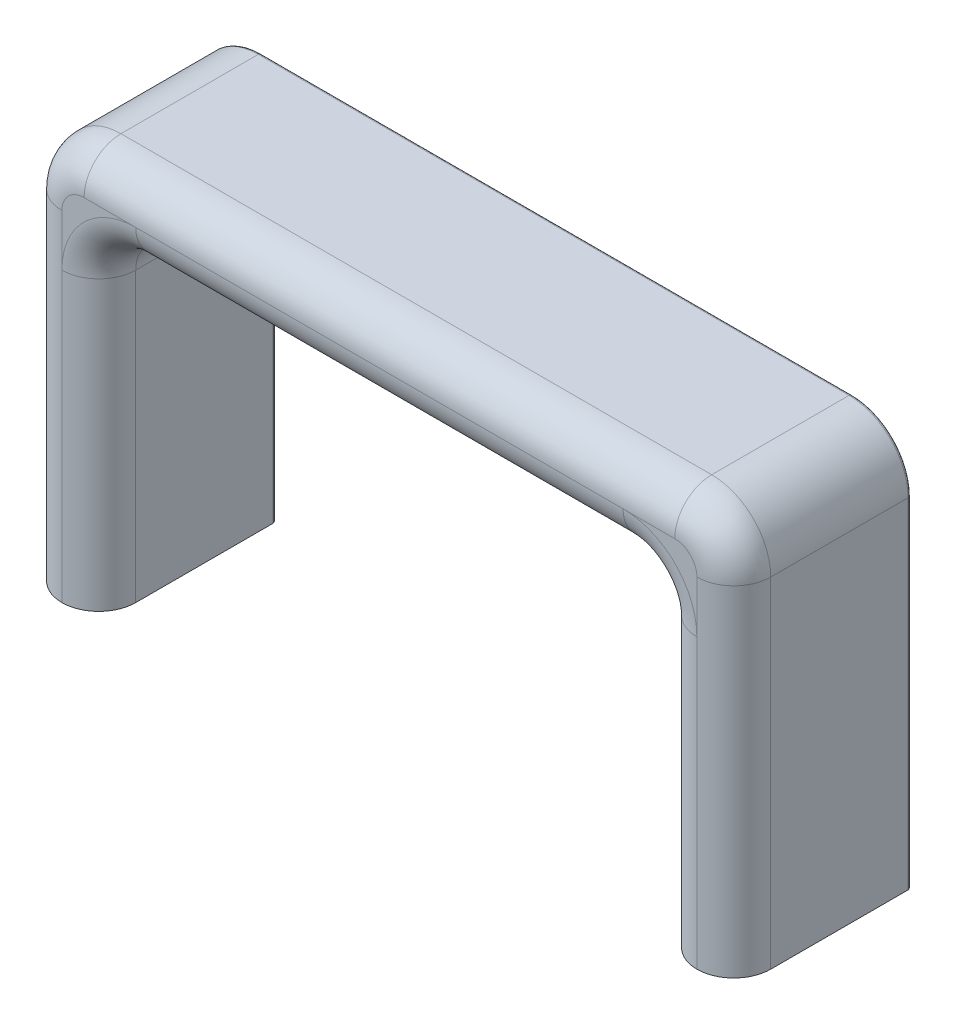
ISO-10303-21;
HEADER;
FILE_DESCRIPTION(('STEP AP214'),'2;1');
FILE_NAME('part.step','',(''),(''),'','','');
FILE_SCHEMA(('AUTOMOTIVE_DESIGN { 1 0 10303 214 1 1 1 1 }'));
ENDSEC;
DATA;
#1=APPLICATION_CONTEXT('core data for automotive mechanical design processes');
#2=APPLICATION_PROTOCOL_DEFINITION('international standard','automotive_design',2000,#1);
#3=PRODUCT_CONTEXT('',#1,'mechanical');
#4=PRODUCT('Part','Part','',(#3));
#5=PRODUCT_RELATED_PRODUCT_CATEGORY('part','',(#4));
#6=PRODUCT_DEFINITION_FORMATION('','',#4);
#7=PRODUCT_DEFINITION_CONTEXT('part definition',#1,'design');
#8=PRODUCT_DEFINITION('design','',#6,#7);
#9=PRODUCT_DEFINITION_SHAPE('','',#8);
#10=(LENGTH_UNIT() NAMED_UNIT(*) SI_UNIT(.MILLI.,.METRE.));
#11=(NAMED_UNIT(*) PLANE_ANGLE_UNIT() SI_UNIT($,.RADIAN.));
#12=(NAMED_UNIT(*) SI_UNIT($,.STERADIAN.) SOLID_ANGLE_UNIT());
#13=UNCERTAINTY_MEASURE_WITH_UNIT(LENGTH_MEASURE(1.E-05),#10,'distance_accuracy_value','');
#14=(GEOMETRIC_REPRESENTATION_CONTEXT(3) GLOBAL_UNCERTAINTY_ASSIGNED_CONTEXT((#13)) GLOBAL_UNIT_ASSIGNED_CONTEXT((#10,
#11,#12)) REPRESENTATION_CONTEXT('',''));
#15=CARTESIAN_POINT('',(0.,0.,0.));
#16=DIRECTION('',(0.,0.,1.));
#17=DIRECTION('',(1.,0.,0.));
#18=AXIS2_PLACEMENT_3D('',#15,#16,#17);
#19=CARTESIAN_POINT('',(-43.9999999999,22.9999999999,0.2));
#20=DIRECTION('',(0.,0.,1.));
#21=DIRECTION('',(1.,0.,0.));
#22=AXIS2_PLACEMENT_3D('',#19,#20,#21);
#23=TOROIDAL_SURFACE('',#22,2.7,0.2);
#24=CARTESIAN_POINT('',(-44.000000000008,25.7,0.2));
#25=DIRECTION('',(-1.,-4.00027233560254E-11,0.));
#26=DIRECTION('',(4.00027233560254E-11,-1.,0.));
#27=AXIS2_PLACEMENT_3D('',#24,#25,#26);
#28=CIRCLE('',#27,0.2);
#29=CARTESIAN_POINT('',(-44.000000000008,25.7,0.));
#30=VERTEX_POINT('',#29);
#31=CARTESIAN_POINT('',(-44.,25.5,0.2));
#32=VERTEX_POINT('',#31);
#33=EDGE_CURVE('E19',#30,#32,#28,.T.);
#34=ORIENTED_EDGE('',*,*,#33,.T.);
#35=CARTESIAN_POINT('',(-43.9999999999,22.9999999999,0.2));
#36=DIRECTION('',(0.,0.,-1.));
#37=DIRECTION('',(1.,0.,0.));
#38=AXIS2_PLACEMENT_3D('',#35,#36,#37);
#39=CIRCLE('',#38,2.5);
#40=CARTESIAN_POINT('',(-46.4999999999,23.,0.2));
#41=VERTEX_POINT('',#40);
#42=EDGE_CURVE('E539',#41,#32,#39,.T.);
#43=ORIENTED_EDGE('',*,*,#42,.F.);
#44=CARTESIAN_POINT('',(-46.7,23.,0.2));
#45=DIRECTION('',(0.,1.,4.00027233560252E-11));
#46=DIRECTION('',(0.,-4.00027233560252E-11,1.));
#47=AXIS2_PLACEMENT_3D('',#44,#45,#46);
#48=CIRCLE('',#47,0.2);
#49=CARTESIAN_POINT('',(-46.7,23.000000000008,0.));
#50=VERTEX_POINT('',#49);
#51=EDGE_CURVE('E10',#41,#50,#48,.T.);
#52=ORIENTED_EDGE('',*,*,#51,.T.);
#53=CARTESIAN_POINT('',(-43.9999999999,22.9999999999,0.));
#54=DIRECTION('',(0.,0.,1.));
#55=DIRECTION('',(1.,0.,0.));
#56=AXIS2_PLACEMENT_3D('',#53,#54,#55);
#57=CIRCLE('',#56,2.7);
#58=EDGE_CURVE('E543',#30,#50,#57,.T.);
#59=ORIENTED_EDGE('',*,*,#58,.F.);
#60=EDGE_LOOP('',(#34,#43,#52,#59));
#61=FACE_BOUND('',#60,.T.);
#62=ADVANCED_FACE('F16',(#61),#23,.T.);
#63=CARTESIAN_POINT('',(-46.7,13.1636089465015,0.2));
#64=DIRECTION('',(0.,-1.,0.));
#65=DIRECTION('',(0.,0.,-1.));
#66=AXIS2_PLACEMENT_3D('',#63,#64,#65);
#67=CYLINDRICAL_SURFACE('',#66,0.2);
#68=CARTESIAN_POINT('',(-46.5,0.,0.2));
#69=CARTESIAN_POINT('',(-46.5,0.,0.0828427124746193));
#70=CARTESIAN_POINT('',(-46.5828427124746,0.0828427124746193,0.));
#71=CARTESIAN_POINT('',(-46.7,0.2,0.));
#72=(BOUNDED_CURVE() B_SPLINE_CURVE(3,(#68,#69,#70,#71),.UNSPECIFIED.,.F.,
.F.) B_SPLINE_CURVE_WITH_KNOTS((4,4),(0.,1.5707963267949),
.UNSPECIFIED.) CURVE() GEOMETRIC_REPRESENTATION_ITEM() RATIONAL_B_SPLINE_CURVE((1.,
0.804737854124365,0.804737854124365,1.)) REPRESENTATION_ITEM(''));
#73=CARTESIAN_POINT('',(-46.5,0.,0.2));
#74=VERTEX_POINT('',#73);
#75=CARTESIAN_POINT('',(-46.7,0.2,0.));
#76=VERTEX_POINT('',#75);
#77=EDGE_CURVE('E516',#74,#76,#72,.T.);
#78=ORIENTED_EDGE('',*,*,#77,.T.);
#79=DIRECTION('',(0.,-1.,0.));
#80=VECTOR('',#79,1.);
#81=CARTESIAN_POINT('',(-46.7,13.1636089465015,0.));
#82=LINE('',#81,#80);
#83=EDGE_CURVE('E1038',#50,#76,#82,.T.);
#84=ORIENTED_EDGE('',*,*,#83,.F.);
#85=ORIENTED_EDGE('',*,*,#51,.F.);
#86=DIRECTION('',(0.,1.,0.));
#87=VECTOR('',#86,1.);
#88=CARTESIAN_POINT('',(-46.5,11.5,0.2));
#89=LINE('',#88,#87);
#90=EDGE_CURVE('E617',#74,#41,#89,.T.);
#91=ORIENTED_EDGE('',*,*,#90,.F.);
#92=EDGE_LOOP('',(#78,#84,#85,#91));
#93=FACE_BOUND('',#92,.T.);
#94=ADVANCED_FACE('F1035',(#93),#67,.T.);
#95=CARTESIAN_POINT('',(-24.,25.7,0.2));
#96=DIRECTION('',(-1.,0.,0.));
#97=DIRECTION('',(0.,0.,1.));
#98=AXIS2_PLACEMENT_3D('',#95,#96,#97);
#99=CYLINDRICAL_SURFACE('',#98,0.2);
#100=CARTESIAN_POINT('',(-4.,25.6999999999,0.2));
#101=DIRECTION('',(-1.,0.,0.));
#102=DIRECTION('',(0.,0.,1.));
#103=AXIS2_PLACEMENT_3D('',#100,#101,#102);
#104=CIRCLE('',#103,0.2);
#105=CARTESIAN_POINT('',(-4.,25.6999999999,0.));
#106=VERTEX_POINT('',#105);
#107=CARTESIAN_POINT('',(-4.,25.4999999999,0.2));
#108=VERTEX_POINT('',#107);
#109=EDGE_CURVE('E511',#106,#108,#104,.T.);
#110=ORIENTED_EDGE('',*,*,#109,.T.);
#111=DIRECTION('',(1.,0.,0.));
#112=VECTOR('',#111,1.);
#113=CARTESIAN_POINT('',(-24.,25.5,0.2));
#114=LINE('',#113,#112);
#115=EDGE_CURVE('E560',#32,#108,#114,.T.);
#116=ORIENTED_EDGE('',*,*,#115,.F.);
#117=ORIENTED_EDGE('',*,*,#33,.F.);
#118=DIRECTION('',(-1.,0.,0.));
#119=VECTOR('',#118,1.);
#120=CARTESIAN_POINT('',(-24.,25.7,0.));
#121=LINE('',#120,#119);
#122=EDGE_CURVE('E1761',#106,#30,#121,.T.);
#123=ORIENTED_EDGE('',*,*,#122,.F.);
#124=EDGE_LOOP('',(#110,#116,#117,#123));
#125=FACE_BOUND('',#124,.T.);
#126=ADVANCED_FACE('F561',(#125),#99,.T.);
#127=CARTESIAN_POINT('',(-24.,0.2,0.2));
#128=DIRECTION('',(-1.,0.,0.));
#129=DIRECTION('',(0.,0.,1.));
#130=AXIS2_PLACEMENT_3D('',#127,#128,#129);
#131=CYLINDRICAL_SURFACE('',#130,0.2);
#132=CARTESIAN_POINT('',(-48.,0.,0.2));
#133=CARTESIAN_POINT('',(-48.,0.,0.0828427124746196));
#134=CARTESIAN_POINT('',(-47.9171572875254,0.0828427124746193,0.));
#135=CARTESIAN_POINT('',(-47.8,0.2,0.));
#136=(BOUNDED_CURVE() B_SPLINE_CURVE(3,(#132,#133,#134,#135),.UNSPECIFIED.,.F.,
.F.) B_SPLINE_CURVE_WITH_KNOTS((4,4),(0.,1.5707963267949),
.UNSPECIFIED.) CURVE() GEOMETRIC_REPRESENTATION_ITEM() RATIONAL_B_SPLINE_CURVE((1.,
0.804737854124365,0.804737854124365,1.)) REPRESENTATION_ITEM(''));
#137=CARTESIAN_POINT('',(-48.,0.,0.2));
#138=VERTEX_POINT('',#137);
#139=CARTESIAN_POINT('',(-47.8,0.2,0.));
#140=VERTEX_POINT('',#139);
#141=EDGE_CURVE('E405',#138,#140,#136,.T.);
#142=ORIENTED_EDGE('',*,*,#141,.T.);
#143=DIRECTION('',(-1.,0.,0.));
#144=VECTOR('',#143,1.);
#145=CARTESIAN_POINT('',(-48.,0.2,0.));
#146=LINE('',#145,#144);
#147=EDGE_CURVE('E1742',#76,#140,#146,.T.);
#148=ORIENTED_EDGE('',*,*,#147,.F.);
#149=ORIENTED_EDGE('',*,*,#77,.F.);
#150=DIRECTION('',(1.,0.,0.));
#151=VECTOR('',#150,1.);
#152=CARTESIAN_POINT('',(-46.5,0.,0.2));
#153=LINE('',#152,#151);
#154=EDGE_CURVE('E598',#138,#74,#153,.T.);
#155=ORIENTED_EDGE('',*,*,#154,.F.);
#156=EDGE_LOOP('',(#142,#148,#149,#155));
#157=FACE_BOUND('',#156,.T.);
#158=ADVANCED_FACE('F2617',(#157),#131,.T.);
#159=CARTESIAN_POINT('',(-4.0000000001,22.9999999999,0.2));
#160=DIRECTION('',(0.,0.,1.));
#161=DIRECTION('',(1.,0.,0.));
#162=AXIS2_PLACEMENT_3D('',#159,#160,#161);
#163=TOROIDAL_SURFACE('',#162,2.7,0.2);
#164=CARTESIAN_POINT('',(-1.3,23.000000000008,0.2));
#165=DIRECTION('',(-4.00027233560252E-11,1.,0.));
#166=DIRECTION('',(-1.,-4.00027233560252E-11,0.));
#167=AXIS2_PLACEMENT_3D('',#164,#165,#166);
#168=CIRCLE('',#167,0.2);
#169=CARTESIAN_POINT('',(-1.3,23.000000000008,0.));
#170=VERTEX_POINT('',#169);
#171=CARTESIAN_POINT('',(-1.5,23.,0.2));
#172=VERTEX_POINT('',#171);
#173=EDGE_CURVE('E402',#170,#172,#168,.T.);
#174=ORIENTED_EDGE('',*,*,#173,.T.);
#175=CARTESIAN_POINT('',(-4.0000000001,22.9999999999,0.2));
#176=DIRECTION('',(0.,0.,-1.));
#177=DIRECTION('',(1.,0.,0.));
#178=AXIS2_PLACEMENT_3D('',#175,#176,#177);
#179=CIRCLE('',#178,2.5);
#180=EDGE_CURVE('E577',#108,#172,#179,.T.);
#181=ORIENTED_EDGE('',*,*,#180,.F.);
#182=ORIENTED_EDGE('',*,*,#109,.F.);
#183=CARTESIAN_POINT('',(-4.0000000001,22.9999999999,0.));
#184=DIRECTION('',(0.,0.,1.));
#185=DIRECTION('',(1.,0.,0.));
#186=AXIS2_PLACEMENT_3D('',#183,#184,#185);
#187=CIRCLE('',#186,2.7);
#188=EDGE_CURVE('E1677',#170,#106,#187,.T.);
#189=ORIENTED_EDGE('',*,*,#188,.F.);
#190=EDGE_LOOP('',(#174,#181,#182,#189));
#191=FACE_BOUND('',#190,.T.);
#192=ADVANCED_FACE('F2481',(#191),#163,.T.);
#193=CARTESIAN_POINT('',(-47.8,11.5,0.2));
#194=DIRECTION('',(0.,1.,0.));
#195=DIRECTION('',(0.,0.,1.));
#196=AXIS2_PLACEMENT_3D('',#193,#194,#195);
#197=CYLINDRICAL_SURFACE('',#196,0.2);
#198=CARTESIAN_POINT('',(-47.7999999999,22.999999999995,0.2));
#199=DIRECTION('',(-2.49973652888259E-11,-1.,0.));
#200=DIRECTION('',(1.,-2.49973652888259E-11,0.));
#201=AXIS2_PLACEMENT_3D('',#198,#199,#200);
#202=CIRCLE('',#201,0.2);
#203=CARTESIAN_POINT('',(-47.9999999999,23.,0.2));
#204=VERTEX_POINT('',#203);
#205=CARTESIAN_POINT('',(-47.8,22.999999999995,0.));
#206=VERTEX_POINT('',#205);
#207=EDGE_CURVE('E406',#204,#206,#202,.T.);
#208=ORIENTED_EDGE('',*,*,#207,.T.);
#209=DIRECTION('',(0.,1.,0.));
#210=VECTOR('',#209,1.);
#211=CARTESIAN_POINT('',(-47.8,23.,0.));
#212=LINE('',#211,#210);
#213=EDGE_CURVE('E1735',#140,#206,#212,.T.);
#214=ORIENTED_EDGE('',*,*,#213,.F.);
#215=ORIENTED_EDGE('',*,*,#141,.F.);
#216=DIRECTION('',(0.,-1.,0.));
#217=VECTOR('',#216,1.);
#218=CARTESIAN_POINT('',(-48.,0.,0.2));
#219=LINE('',#218,#217);
#220=EDGE_CURVE('E1120',#204,#138,#219,.T.);
#221=ORIENTED_EDGE('',*,*,#220,.F.);
#222=EDGE_LOOP('',(#208,#214,#215,#221));
#223=FACE_BOUND('',#222,.T.);
#224=ADVANCED_FACE('F2147',(#223),#197,.T.);
#225=CARTESIAN_POINT('',(-1.3,13.1636089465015,0.2));
#226=DIRECTION('',(0.,1.,0.));
#227=DIRECTION('',(0.,0.,1.));
#228=AXIS2_PLACEMENT_3D('',#225,#226,#227);
#229=CYLINDRICAL_SURFACE('',#228,0.2);
#230=CARTESIAN_POINT('',(-1.3,0.2,0.));
#231=CARTESIAN_POINT('',(-1.41715728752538,0.0828427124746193,0.));
#232=CARTESIAN_POINT('',(-1.5,0.,0.0828427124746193));
#233=CARTESIAN_POINT('',(-1.5,0.,0.2));
#234=(BOUNDED_CURVE() B_SPLINE_CURVE(3,(#230,#231,#232,#233),.UNSPECIFIED.,.F.,
.F.) B_SPLINE_CURVE_WITH_KNOTS((4,4),(4.71238898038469,6.28318530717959),
.UNSPECIFIED.) CURVE() GEOMETRIC_REPRESENTATION_ITEM() RATIONAL_B_SPLINE_CURVE((1.,
0.804737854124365,0.804737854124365,1.)) REPRESENTATION_ITEM(''));
#235=CARTESIAN_POINT('',(-1.3,0.2,0.));
#236=VERTEX_POINT('',#235);
#237=CARTESIAN_POINT('',(-1.5,0.,0.2));
#238=VERTEX_POINT('',#237);
#239=EDGE_CURVE('E495',#236,#238,#234,.T.);
#240=ORIENTED_EDGE('',*,*,#239,.T.);
#241=DIRECTION('',(0.,-1.,0.));
#242=VECTOR('',#241,1.);
#243=CARTESIAN_POINT('',(-1.5,11.5,0.2));
#244=LINE('',#243,#242);
#245=EDGE_CURVE('E949',#172,#238,#244,.T.);
#246=ORIENTED_EDGE('',*,*,#245,.F.);
#247=ORIENTED_EDGE('',*,*,#173,.F.);
#248=DIRECTION('',(0.,1.,0.));
#249=VECTOR('',#248,1.);
#250=CARTESIAN_POINT('',(-1.3,13.1636089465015,0.));
#251=LINE('',#250,#249);
#252=EDGE_CURVE('E1685',#236,#170,#251,.T.);
#253=ORIENTED_EDGE('',*,*,#252,.F.);
#254=EDGE_LOOP('',(#240,#246,#247,#253));
#255=FACE_BOUND('',#254,.T.);
#256=ADVANCED_FACE('F2141',(#255),#229,.T.);
#257=CARTESIAN_POINT('',(-43.9999999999,22.9999999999,0.2));
#258=DIRECTION('',(0.,0.,1.));
#259=DIRECTION('',(1.,0.,0.));
#260=AXIS2_PLACEMENT_3D('',#257,#258,#259);
#261=TOROIDAL_SURFACE('',#260,3.8,0.2);
#262=CARTESIAN_POINT('',(-44.,26.8,0.2));
#263=DIRECTION('',(-1.,0.,0.));
#264=DIRECTION('',(0.,0.,1.));
#265=AXIS2_PLACEMENT_3D('',#262,#263,#264);
#266=CIRCLE('',#265,0.2);
#267=CARTESIAN_POINT('',(-44.,27.,0.2));
#268=VERTEX_POINT('',#267);
#269=CARTESIAN_POINT('',(-44.,26.7999999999,0.));
#270=VERTEX_POINT('',#269);
#271=EDGE_CURVE('E488',#268,#270,#266,.T.);
#272=ORIENTED_EDGE('',*,*,#271,.T.);
#273=CARTESIAN_POINT('',(-43.9999999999,22.9999999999,0.));
#274=DIRECTION('',(0.,0.,-1.));
#275=DIRECTION('',(1.,0.,0.));
#276=AXIS2_PLACEMENT_3D('',#273,#274,#275);
#277=CIRCLE('',#276,3.8);
#278=EDGE_CURVE('E1727',#206,#270,#277,.T.);
#279=ORIENTED_EDGE('',*,*,#278,.F.);
#280=ORIENTED_EDGE('',*,*,#207,.F.);
#281=CARTESIAN_POINT('',(-43.9999999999,22.9999999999,0.2));
#282=DIRECTION('',(0.,0.,1.));
#283=DIRECTION('',(1.,0.,0.));
#284=AXIS2_PLACEMENT_3D('',#281,#282,#283);
#285=CIRCLE('',#284,4.);
#286=EDGE_CURVE('E895',#268,#204,#285,.T.);
#287=ORIENTED_EDGE('',*,*,#286,.F.);
#288=EDGE_LOOP('',(#272,#279,#280,#287));
#289=FACE_BOUND('',#288,.T.);
#290=ADVANCED_FACE('F2146',(#289),#261,.T.);
#291=CARTESIAN_POINT('',(-24.,0.2,0.2));
#292=DIRECTION('',(-1.,0.,0.));
#293=DIRECTION('',(0.,0.,1.));
#294=AXIS2_PLACEMENT_3D('',#291,#292,#293);
#295=CYLINDRICAL_SURFACE('',#294,0.2);
#296=CARTESIAN_POINT('',(-0.2,0.2,0.));
#297=CARTESIAN_POINT('',(-0.0828427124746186,0.0828427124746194,0.));
#298=CARTESIAN_POINT('',(0.,0.,0.0828427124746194));
#299=CARTESIAN_POINT('',(0.,0.,0.2));
#300=(BOUNDED_CURVE() B_SPLINE_CURVE(3,(#296,#297,#298,#299),.UNSPECIFIED.,.F.,
.F.) B_SPLINE_CURVE_WITH_KNOTS((4,4),(4.71238898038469,6.28318530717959),
.UNSPECIFIED.) CURVE() GEOMETRIC_REPRESENTATION_ITEM() RATIONAL_B_SPLINE_CURVE((1.,
0.804737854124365,0.804737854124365,1.)) REPRESENTATION_ITEM(''));
#301=CARTESIAN_POINT('',(-0.2,0.2,0.));
#302=VERTEX_POINT('',#301);
#303=CARTESIAN_POINT('',(0.,0.,0.2));
#304=VERTEX_POINT('',#303);
#305=EDGE_CURVE('E483',#302,#304,#300,.T.);
#306=ORIENTED_EDGE('',*,*,#305,.T.);
#307=DIRECTION('',(1.,0.,0.));
#308=VECTOR('',#307,1.);
#309=CARTESIAN_POINT('',(0.,0.,0.2));
#310=LINE('',#309,#308);
#311=EDGE_CURVE('E589',#238,#304,#310,.T.);
#312=ORIENTED_EDGE('',*,*,#311,.F.);
#313=ORIENTED_EDGE('',*,*,#239,.F.);
#314=DIRECTION('',(-1.,0.,0.));
#315=VECTOR('',#314,1.);
#316=CARTESIAN_POINT('',(-1.5,0.2,0.));
#317=LINE('',#316,#315);
#318=EDGE_CURVE('E1693',#302,#236,#317,.T.);
#319=ORIENTED_EDGE('',*,*,#318,.F.);
#320=EDGE_LOOP('',(#306,#312,#313,#319));
#321=FACE_BOUND('',#320,.T.);
#322=ADVANCED_FACE('F2511',(#321),#295,.T.);
#323=CARTESIAN_POINT('',(-24.,26.8,0.2));
#324=DIRECTION('',(1.,0.,0.));
#325=DIRECTION('',(0.,0.,-1.));
#326=AXIS2_PLACEMENT_3D('',#323,#324,#325);
#327=CYLINDRICAL_SURFACE('',#326,0.2);
#328=CARTESIAN_POINT('',(-4.000000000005,26.7999999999,0.2));
#329=DIRECTION('',(-1.,2.49973652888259E-11,0.));
#330=DIRECTION('',(-2.49973652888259E-11,-1.,0.));
#331=AXIS2_PLACEMENT_3D('',#328,#329,#330);
#332=CIRCLE('',#331,0.2);
#333=CARTESIAN_POINT('',(-4.,26.9999999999,0.2));
#334=VERTEX_POINT('',#333);
#335=CARTESIAN_POINT('',(-4.000000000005,26.8,0.));
#336=VERTEX_POINT('',#335);
#337=EDGE_CURVE('E473',#334,#336,#332,.T.);
#338=ORIENTED_EDGE('',*,*,#337,.T.);
#339=DIRECTION('',(1.,0.,0.));
#340=VECTOR('',#339,1.);
#341=CARTESIAN_POINT('',(-4.,26.8,0.));
#342=LINE('',#341,#340);
#343=EDGE_CURVE('E1719',#270,#336,#342,.T.);
#344=ORIENTED_EDGE('',*,*,#343,.F.);
#345=ORIENTED_EDGE('',*,*,#271,.F.);
#346=DIRECTION('',(-1.,0.,0.));
#347=VECTOR('',#346,1.);
#348=CARTESIAN_POINT('',(-44.,27.,0.2));
#349=LINE('',#348,#347);
#350=EDGE_CURVE('E1660',#334,#268,#349,.T.);
#351=ORIENTED_EDGE('',*,*,#350,.F.);
#352=EDGE_LOOP('',(#338,#344,#345,#351));
#353=FACE_BOUND('',#352,.T.);
#354=ADVANCED_FACE('F2516',(#353),#327,.T.);
#355=CARTESIAN_POINT('',(-0.2,11.5,0.2));
#356=DIRECTION('',(0.,-1.,0.));
#357=DIRECTION('',(0.,0.,-1.));
#358=AXIS2_PLACEMENT_3D('',#355,#356,#357);
#359=CYLINDRICAL_SURFACE('',#358,0.2);
#360=CARTESIAN_POINT('',(-0.2000000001,23.,0.2));
#361=DIRECTION('',(0.,-1.,0.));
#362=DIRECTION('',(0.,0.,-1.));
#363=AXIS2_PLACEMENT_3D('',#360,#361,#362);
#364=CIRCLE('',#363,0.2);
#365=CARTESIAN_POINT('',(-0.2000000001,23.,0.));
#366=VERTEX_POINT('',#365);
#367=CARTESIAN_POINT('',(0.,23.,0.2));
#368=VERTEX_POINT('',#367);
#369=EDGE_CURVE('E480',#366,#368,#364,.T.);
#370=ORIENTED_EDGE('',*,*,#369,.T.);
#371=DIRECTION('',(0.,1.,0.));
#372=VECTOR('',#371,1.);
#373=CARTESIAN_POINT('',(0.,23.,0.2));
#374=LINE('',#373,#372);
#375=EDGE_CURVE('E856',#304,#368,#374,.T.);
#376=ORIENTED_EDGE('',*,*,#375,.F.);
#377=ORIENTED_EDGE('',*,*,#305,.F.);
#378=DIRECTION('',(0.,-1.,0.));
#379=VECTOR('',#378,1.);
#380=CARTESIAN_POINT('',(-0.2,0.,0.));
#381=LINE('',#380,#379);
#382=EDGE_CURVE('E1702',#366,#302,#381,.T.);
#383=ORIENTED_EDGE('',*,*,#382,.F.);
#384=EDGE_LOOP('',(#370,#376,#377,#383));
#385=FACE_BOUND('',#384,.T.);
#386=ADVANCED_FACE('F2575',(#385),#359,.T.);
#387=CARTESIAN_POINT('',(-4.0000000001,22.9999999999,0.2));
#388=DIRECTION('',(0.,0.,1.));
#389=DIRECTION('',(1.,0.,0.));
#390=AXIS2_PLACEMENT_3D('',#387,#388,#389);
#391=TOROIDAL_SURFACE('',#390,3.8,0.2);
#392=ORIENTED_EDGE('',*,*,#337,.F.);
#393=CARTESIAN_POINT('',(-4.0000000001,22.9999999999,0.2));
#394=DIRECTION('',(0.,0.,1.));
#395=DIRECTION('',(1.,0.,0.));
#396=AXIS2_PLACEMENT_3D('',#393,#394,#395);
#397=CIRCLE('',#396,4.);
#398=EDGE_CURVE('E896',#368,#334,#397,.T.);
#399=ORIENTED_EDGE('',*,*,#398,.F.);
#400=ORIENTED_EDGE('',*,*,#369,.F.);
#401=CARTESIAN_POINT('',(-4.0000000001,22.9999999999,0.));
#402=DIRECTION('',(0.,0.,-1.));
#403=DIRECTION('',(1.,0.,0.));
#404=AXIS2_PLACEMENT_3D('',#401,#402,#403);
#405=CIRCLE('',#404,3.8);
#406=EDGE_CURVE('E1711',#336,#366,#405,.T.);
#407=ORIENTED_EDGE('',*,*,#406,.F.);
#408=EDGE_LOOP('',(#392,#399,#400,#407));
#409=FACE_BOUND('',#408,.T.);
#410=ADVANCED_FACE('F2563',(#409),#391,.T.);
#411=CARTESIAN_POINT('',(-24.0000000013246,0.2,0.2));
#412=DIRECTION('',(1.,0.,0.));
#413=DIRECTION('',(0.,0.,-1.));
#414=AXIS2_PLACEMENT_3D('',#411,#412,#413);
#415=CYLINDRICAL_SURFACE('',#414,0.2);
#416=CARTESIAN_POINT('',(-2.97857930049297,0.2,0.));
#417=CARTESIAN_POINT('',(-2.83855823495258,0.0828427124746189,0.));
#418=CARTESIAN_POINT('',(-2.73954839,0.,0.0828427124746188));
#419=CARTESIAN_POINT('',(-2.73954839,0.,0.2));
#420=(BOUNDED_CURVE() B_SPLINE_CURVE(3,(#416,#417,#418,#419),.UNSPECIFIED.,.F.,
.F.) B_SPLINE_CURVE_WITH_KNOTS((4,4),(1.5707963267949,3.1415926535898),
.UNSPECIFIED.) CURVE() GEOMETRIC_REPRESENTATION_ITEM() RATIONAL_B_SPLINE_CURVE((1.,
0.804737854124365,0.804737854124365,1.)) REPRESENTATION_ITEM(''));
#421=CARTESIAN_POINT('',(-2.97857930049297,0.2,0.));
#422=VERTEX_POINT('',#421);
#423=CARTESIAN_POINT('',(-2.73954839,0.,0.2));
#424=VERTEX_POINT('',#423);
#425=EDGE_CURVE('E460',#422,#424,#420,.T.);
#426=ORIENTED_EDGE('',*,*,#425,.T.);
#427=DIRECTION('',(1.,0.,0.));
#428=VECTOR('',#427,1.);
#429=CARTESIAN_POINT('',(-2.73954839,0.,0.2));
#430=LINE('',#429,#428);
#431=CARTESIAN_POINT('',(-5.,0.,0.2));
#432=VERTEX_POINT('',#431);
#433=EDGE_CURVE('E376',#432,#424,#430,.T.);
#434=ORIENTED_EDGE('',*,*,#433,.F.);
#435=CARTESIAN_POINT('',(-5.,0.,0.2));
#436=CARTESIAN_POINT('',(-5.,0.,0.0828427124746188));
#437=CARTESIAN_POINT('',(-4.91715728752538,0.0828427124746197,0.));
#438=CARTESIAN_POINT('',(-4.8,0.2,0.));
#439=(BOUNDED_CURVE() B_SPLINE_CURVE(3,(#435,#436,#437,#438),.UNSPECIFIED.,.F.,
.F.) B_SPLINE_CURVE_WITH_KNOTS((4,4),(3.1415926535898,4.71238898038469),
.UNSPECIFIED.) CURVE() GEOMETRIC_REPRESENTATION_ITEM() RATIONAL_B_SPLINE_CURVE((1.,
0.804737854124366,0.804737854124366,1.)) REPRESENTATION_ITEM(''));
#440=CARTESIAN_POINT('',(-4.8,0.2,0.));
#441=VERTEX_POINT('',#440);
#442=EDGE_CURVE('E465',#432,#441,#439,.T.);
#443=ORIENTED_EDGE('',*,*,#442,.T.);
#444=DIRECTION('',(-1.,0.,0.));
#445=VECTOR('',#444,1.);
#446=CARTESIAN_POINT('',(-5.,0.2,0.));
#447=LINE('',#446,#445);
#448=EDGE_CURVE('E748',#422,#441,#447,.T.);
#449=ORIENTED_EDGE('',*,*,#448,.F.);
#450=EDGE_LOOP('',(#426,#434,#443,#449));
#451=FACE_BOUND('',#450,.T.);
#452=ADVANCED_FACE('F2551',(#451),#415,.T.);
#453=CARTESIAN_POINT('',(-4.8,11.6738442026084,0.2));
#454=DIRECTION('',(0.,1.,0.));
#455=DIRECTION('',(0.,0.,1.));
#456=AXIS2_PLACEMENT_3D('',#453,#454,#455);
#457=CYLINDRICAL_SURFACE('',#456,0.2);
#458=CARTESIAN_POINT('',(-4.8000000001,19.500000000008,0.2));
#459=DIRECTION('',(4.00027233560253E-11,-1.,0.));
#460=DIRECTION('',(1.,4.00027233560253E-11,0.));
#461=AXIS2_PLACEMENT_3D('',#458,#459,#460);
#462=CIRCLE('',#461,0.2);
#463=CARTESIAN_POINT('',(-5.,19.5,0.2));
#464=VERTEX_POINT('',#463);
#465=CARTESIAN_POINT('',(-4.8,19.500000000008,0.));
#466=VERTEX_POINT('',#465);
#467=EDGE_CURVE('E454',#464,#466,#462,.T.);
#468=ORIENTED_EDGE('',*,*,#467,.T.);
#469=DIRECTION('',(0.,1.,0.));
#470=VECTOR('',#469,1.);
#471=CARTESIAN_POINT('',(-4.8,11.6738442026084,0.));
#472=LINE('',#471,#470);
#473=EDGE_CURVE('E744',#441,#466,#472,.T.);
#474=ORIENTED_EDGE('',*,*,#473,.F.);
#475=ORIENTED_EDGE('',*,*,#442,.F.);
#476=DIRECTION('',(0.,-1.,0.));
#477=VECTOR('',#476,1.);
#478=CARTESIAN_POINT('',(-5.,9.75,0.2));
#479=LINE('',#478,#477);
#480=EDGE_CURVE('E384',#464,#432,#479,.T.);
#481=ORIENTED_EDGE('',*,*,#480,.F.);
#482=EDGE_LOOP('',(#468,#474,#475,#481));
#483=FACE_BOUND('',#482,.T.);
#484=ADVANCED_FACE('F2539',(#483),#457,.T.);
#485=CARTESIAN_POINT('',(-5.62514277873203,14.967010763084,0.2));
#486=DIRECTION('',(-0.176410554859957,0.984316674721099,0.));
#487=DIRECTION('',(-0.984316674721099,-0.176410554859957,0.));
#488=AXIS2_PLACEMENT_3D('',#485,#486,#487);
#489=CYLINDRICAL_SURFACE('',#488,0.2);
#490=CARTESIAN_POINT('',(-3.65750689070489,3.98820727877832,0.));
#491=CARTESIAN_POINT('',(-3.53595216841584,3.97408651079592,0.));
#492=CARTESIAN_POINT('',(-3.45,3.96410161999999,0.0828427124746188));
#493=CARTESIAN_POINT('',(-3.45,3.96410162,0.2));
#494=(BOUNDED_CURVE() B_SPLINE_CURVE(3,(#490,#491,#492,#493),.UNSPECIFIED.,.F.,
.F.) B_SPLINE_CURVE_WITH_KNOTS((4,4),(1.5707963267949,3.1415926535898),
.UNSPECIFIED.) CURVE() GEOMETRIC_REPRESENTATION_ITEM() RATIONAL_B_SPLINE_CURVE((1.,
0.804737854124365,0.804737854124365,1.)) REPRESENTATION_ITEM(''));
#495=CARTESIAN_POINT('',(-3.65750689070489,3.98820727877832,0.));
#496=VERTEX_POINT('',#495);
#497=CARTESIAN_POINT('',(-3.45,3.96410162,0.2));
#498=VERTEX_POINT('',#497);
#499=EDGE_CURVE('E446',#496,#498,#494,.T.);
#500=ORIENTED_EDGE('',*,*,#499,.T.);
#501=DIRECTION('',(-0.176410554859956,0.984316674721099,0.));
#502=VECTOR('',#501,1.);
#503=CARTESIAN_POINT('',(-3.45,3.96410162,0.2));
#504=LINE('',#503,#502);
#505=EDGE_CURVE('E677',#424,#498,#504,.T.);
#506=ORIENTED_EDGE('',*,*,#505,.F.);
#507=ORIENTED_EDGE('',*,*,#425,.F.);
#508=DIRECTION('',(0.176410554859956,-0.984316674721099,0.));
#509=VECTOR('',#508,1.);
#510=CARTESIAN_POINT('',(-2.93641172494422,-0.0352821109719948,0.));
#511=LINE('',#510,#509);
#512=EDGE_CURVE('E734',#496,#422,#511,.T.);
#513=ORIENTED_EDGE('',*,*,#512,.F.);
#514=EDGE_LOOP('',(#500,#506,#507,#513));
#515=FACE_BOUND('',#514,.T.);
#516=ADVANCED_FACE('F2528',(#515),#489,.T.);
#517=CARTESIAN_POINT('',(-7.5000000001,19.4999999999,0.2));
#518=DIRECTION('',(0.,0.,1.));
#519=DIRECTION('',(1.,0.,0.));
#520=AXIS2_PLACEMENT_3D('',#517,#518,#519);
#521=TOROIDAL_SURFACE('',#520,2.7,0.2);
#522=CARTESIAN_POINT('',(-7.5,22.2,0.2));
#523=DIRECTION('',(1.,0.,0.));
#524=DIRECTION('',(0.,0.,-1.));
#525=AXIS2_PLACEMENT_3D('',#522,#523,#524);
#526=CIRCLE('',#525,0.2);
#527=CARTESIAN_POINT('',(-7.5,21.9999999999,0.2));
#528=VERTEX_POINT('',#527);
#529=CARTESIAN_POINT('',(-7.5,22.1999999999,0.));
#530=VERTEX_POINT('',#529);
#531=EDGE_CURVE('E445',#528,#530,#526,.T.);
#532=ORIENTED_EDGE('',*,*,#531,.T.);
#533=CARTESIAN_POINT('',(-7.5000000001,19.4999999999,0.));
#534=DIRECTION('',(0.,0.,1.));
#535=DIRECTION('',(1.,0.,0.));
#536=AXIS2_PLACEMENT_3D('',#533,#534,#535);
#537=CIRCLE('',#536,2.7);
#538=EDGE_CURVE('E739',#466,#530,#537,.T.);
#539=ORIENTED_EDGE('',*,*,#538,.F.);
#540=ORIENTED_EDGE('',*,*,#467,.F.);
#541=CARTESIAN_POINT('',(-7.5000000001,19.4999999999,0.2));
#542=DIRECTION('',(0.,0.,-1.));
#543=DIRECTION('',(1.,0.,0.));
#544=AXIS2_PLACEMENT_3D('',#541,#542,#543);
#545=CIRCLE('',#544,2.5);
#546=EDGE_CURVE('E391',#528,#464,#545,.T.);
#547=ORIENTED_EDGE('',*,*,#546,.F.);
#548=EDGE_LOOP('',(#532,#539,#540,#547));
#549=FACE_BOUND('',#548,.T.);
#550=ADVANCED_FACE('F796',(#549),#521,.T.);
#551=CARTESIAN_POINT('',(-4.06697134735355,3.04258962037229,0.2));
#552=DIRECTION('',(0.397359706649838,0.917662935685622,0.));
#553=DIRECTION('',(-0.917662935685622,0.397359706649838,0.));
#554=AXIS2_PLACEMENT_3D('',#551,#552,#553);
#555=CYLINDRICAL_SURFACE('',#554,0.2);
#556=CARTESIAN_POINT('',(-3.4,4.58289397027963,0.));
#557=CARTESIAN_POINT('',(-3.28284271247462,4.55861776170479,0.));
#558=CARTESIAN_POINT('',(-3.2,4.54145189,0.0828427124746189));
#559=CARTESIAN_POINT('',(-3.2,4.54145189,0.2));
#560=(BOUNDED_CURVE() B_SPLINE_CURVE(3,(#556,#557,#558,#559),.UNSPECIFIED.,.F.,
.F.) B_SPLINE_CURVE_WITH_KNOTS((4,4),(1.5707963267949,3.1415926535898),
.UNSPECIFIED.) CURVE() GEOMETRIC_REPRESENTATION_ITEM() RATIONAL_B_SPLINE_CURVE((1.,
0.804737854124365,0.804737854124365,1.)) REPRESENTATION_ITEM(''));
#561=CARTESIAN_POINT('',(-3.4,4.58289397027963,0.));
#562=VERTEX_POINT('',#561);
#563=CARTESIAN_POINT('',(-3.2,4.54145189,0.2));
#564=VERTEX_POINT('',#563);
#565=EDGE_CURVE('E394',#562,#564,#560,.T.);
#566=ORIENTED_EDGE('',*,*,#565,.T.);
#567=DIRECTION('',(0.397359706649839,0.917662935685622,0.));
#568=VECTOR('',#567,1.);
#569=CARTESIAN_POINT('',(-3.2,4.54145189,0.2));
#570=LINE('',#569,#568);
#571=EDGE_CURVE('E685',#498,#564,#570,.T.);
#572=ORIENTED_EDGE('',*,*,#571,.F.);
#573=ORIENTED_EDGE('',*,*,#499,.F.);
#574=DIRECTION('',(-0.397359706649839,-0.917662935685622,0.));
#575=VECTOR('',#574,1.);
#576=CARTESIAN_POINT('',(-3.63353258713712,4.04357356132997,0.));
#577=LINE('',#576,#575);
#578=EDGE_CURVE('E662',#562,#496,#577,.T.);
#579=ORIENTED_EDGE('',*,*,#578,.F.);
#580=EDGE_LOOP('',(#566,#572,#573,#579));
#581=FACE_BOUND('',#580,.T.);
#582=ADVANCED_FACE('F2492',(#581),#555,.T.);
#583=CARTESIAN_POINT('',(-24.0000000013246,22.2,0.2));
#584=DIRECTION('',(-1.,0.,0.));
#585=DIRECTION('',(0.,0.,1.));
#586=AXIS2_PLACEMENT_3D('',#583,#584,#585);
#587=CYLINDRICAL_SURFACE('',#586,0.2);
#588=CARTESIAN_POINT('',(-40.500000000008,22.1999999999,0.2));
#589=DIRECTION('',(1.,4.00027233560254E-11,0.));
#590=DIRECTION('',(-4.00027233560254E-11,1.,0.));
#591=AXIS2_PLACEMENT_3D('',#588,#589,#590);
#592=CIRCLE('',#591,0.2);
#593=CARTESIAN_POINT('',(-40.5,22.,0.2));
#594=VERTEX_POINT('',#593);
#595=CARTESIAN_POINT('',(-40.500000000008,22.2,0.));
#596=VERTEX_POINT('',#595);
#597=EDGE_CURVE('E342',#594,#596,#592,.T.);
#598=ORIENTED_EDGE('',*,*,#597,.T.);
#599=DIRECTION('',(-1.,0.,0.));
#600=VECTOR('',#599,1.);
#601=CARTESIAN_POINT('',(-24.0000000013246,22.2,0.));
#602=LINE('',#601,#600);
#603=EDGE_CURVE('E743',#530,#596,#602,.T.);
#604=ORIENTED_EDGE('',*,*,#603,.F.);
#605=ORIENTED_EDGE('',*,*,#531,.F.);
#606=DIRECTION('',(1.,0.,0.));
#607=VECTOR('',#606,1.);
#608=CARTESIAN_POINT('',(-24.,22.,0.2));
#609=LINE('',#608,#607);
#610=EDGE_CURVE('E597',#594,#528,#609,.T.);
#611=ORIENTED_EDGE('',*,*,#610,.F.);
#612=EDGE_LOOP('',(#598,#604,#605,#611));
#613=FACE_BOUND('',#612,.T.);
#614=ADVANCED_FACE('F788',(#613),#587,.T.);
#615=CARTESIAN_POINT('',(-3.4,11.6738442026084,0.2));
#616=DIRECTION('',(0.,1.,0.));
#617=DIRECTION('',(0.,0.,1.));
#618=AXIS2_PLACEMENT_3D('',#615,#616,#617);
#619=CYLINDRICAL_SURFACE('',#618,0.2);
#620=CARTESIAN_POINT('',(-3.39999999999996,20.00000001,0.2));
#621=DIRECTION('',(0.,-1.,0.));
#622=DIRECTION('',(0.,0.,-1.));
#623=AXIS2_PLACEMENT_3D('',#620,#621,#622);
#624=CIRCLE('',#623,0.2);
#625=CARTESIAN_POINT('',(-3.39999999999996,20.00000001,0.));
#626=VERTEX_POINT('',#625);
#627=CARTESIAN_POINT('',(-3.2,20.00000001,0.2));
#628=VERTEX_POINT('',#627);
#629=EDGE_CURVE('E335',#626,#628,#624,.T.);
#630=ORIENTED_EDGE('',*,*,#629,.T.);
#631=DIRECTION('',(0.,1.,0.));
#632=VECTOR('',#631,1.);
#633=CARTESIAN_POINT('',(-3.2,20.00000001,0.2));
#634=LINE('',#633,#632);
#635=EDGE_CURVE('E689',#564,#628,#634,.T.);
#636=ORIENTED_EDGE('',*,*,#635,.F.);
#637=ORIENTED_EDGE('',*,*,#565,.F.);
#638=DIRECTION('',(0.,-1.,0.));
#639=VECTOR('',#638,1.);
#640=CARTESIAN_POINT('',(-3.4,4.54145189,0.));
#641=LINE('',#640,#639);
#642=EDGE_CURVE('E610',#626,#562,#641,.T.);
#643=ORIENTED_EDGE('',*,*,#642,.F.);
#644=EDGE_LOOP('',(#630,#636,#637,#643));
#645=FACE_BOUND('',#644,.T.);
#646=ADVANCED_FACE('F991',(#645),#619,.T.);
#647=CARTESIAN_POINT('',(-40.4999999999,19.4999999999,0.2));
#648=DIRECTION('',(0.,0.,1.));
#649=DIRECTION('',(1.,0.,0.));
#650=AXIS2_PLACEMENT_3D('',#647,#648,#649);
#651=TOROIDAL_SURFACE('',#650,2.7,0.2);
#652=CARTESIAN_POINT('',(-43.2,19.5,0.2));
#653=DIRECTION('',(0.,1.,0.));
#654=DIRECTION('',(0.,0.,1.));
#655=AXIS2_PLACEMENT_3D('',#652,#653,#654);
#656=CIRCLE('',#655,0.2);
#657=CARTESIAN_POINT('',(-42.9999999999,19.5,0.2));
#658=VERTEX_POINT('',#657);
#659=CARTESIAN_POINT('',(-43.1999999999,19.5,0.));
#660=VERTEX_POINT('',#659);
#661=EDGE_CURVE('E323',#658,#660,#656,.T.);
#662=ORIENTED_EDGE('',*,*,#661,.T.);
#663=CARTESIAN_POINT('',(-40.4999999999,19.4999999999,0.));
#664=DIRECTION('',(0.,0.,1.));
#665=DIRECTION('',(1.,0.,0.));
#666=AXIS2_PLACEMENT_3D('',#663,#664,#665);
#667=CIRCLE('',#666,2.7);
#668=EDGE_CURVE('E755',#596,#660,#667,.T.);
#669=ORIENTED_EDGE('',*,*,#668,.F.);
#670=ORIENTED_EDGE('',*,*,#597,.F.);
#671=CARTESIAN_POINT('',(-40.4999999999,19.4999999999,0.2));
#672=DIRECTION('',(0.,0.,-1.));
#673=DIRECTION('',(1.,0.,0.));
#674=AXIS2_PLACEMENT_3D('',#671,#672,#673);
#675=CIRCLE('',#674,2.5);
#676=EDGE_CURVE('E339',#658,#594,#675,.T.);
#677=ORIENTED_EDGE('',*,*,#676,.F.);
#678=EDGE_LOOP('',(#662,#669,#670,#677));
#679=FACE_BOUND('',#678,.T.);
#680=ADVANCED_FACE('F341',(#679),#651,.T.);
#681=CARTESIAN_POINT('',(-7.4999999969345,20.0000000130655,0.2));
#682=DIRECTION('',(0.,0.,1.));
#683=DIRECTION('',(1.,0.,0.));
#684=AXIS2_PLACEMENT_3D('',#681,#682,#683);
#685=TOROIDAL_SURFACE('',#684,4.09999999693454,0.2);
#686=CARTESIAN_POINT('',(-7.49999999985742,24.10000001,0.2));
#687=DIRECTION('',(1.,7.12906296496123E-10,0.));
#688=DIRECTION('',(-7.12906296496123E-10,1.,0.));
#689=AXIS2_PLACEMENT_3D('',#686,#687,#688);
#690=CIRCLE('',#689,0.2);
#691=CARTESIAN_POINT('',(-7.49999999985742,24.10000001,0.));
#692=VERTEX_POINT('',#691);
#693=CARTESIAN_POINT('',(-7.5,24.30000001,0.2));
#694=VERTEX_POINT('',#693);
#695=EDGE_CURVE('E336',#692,#694,#690,.T.);
#696=ORIENTED_EDGE('',*,*,#695,.T.);
#697=CARTESIAN_POINT('',(-7.4999999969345,20.0000000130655,0.2));
#698=DIRECTION('',(0.,0.,1.));
#699=DIRECTION('',(1.,0.,0.));
#700=AXIS2_PLACEMENT_3D('',#697,#698,#699);
#701=CIRCLE('',#700,4.29999999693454);
#702=EDGE_CURVE('E877',#628,#694,#701,.T.);
#703=ORIENTED_EDGE('',*,*,#702,.F.);
#704=ORIENTED_EDGE('',*,*,#629,.F.);
#705=CARTESIAN_POINT('',(-7.4999999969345,20.0000000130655,0.));
#706=DIRECTION('',(0.,0.,-1.));
#707=DIRECTION('',(1.,0.,0.));
#708=AXIS2_PLACEMENT_3D('',#705,#706,#707);
#709=CIRCLE('',#708,4.09999999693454);
#710=EDGE_CURVE('E607',#692,#626,#709,.T.);
#711=ORIENTED_EDGE('',*,*,#710,.F.);
#712=EDGE_LOOP('',(#696,#703,#704,#711));
#713=FACE_BOUND('',#712,.T.);
#714=ADVANCED_FACE('F970',(#713),#685,.T.);
#715=CARTESIAN_POINT('',(-43.2,11.6738442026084,0.2));
#716=DIRECTION('',(0.,-1.,0.));
#717=DIRECTION('',(0.,0.,-1.));
#718=AXIS2_PLACEMENT_3D('',#715,#716,#717);
#719=CYLINDRICAL_SURFACE('',#718,0.2);
#720=CARTESIAN_POINT('',(-43.,0.,0.2));
#721=CARTESIAN_POINT('',(-43.,0.,0.0828427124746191));
#722=CARTESIAN_POINT('',(-43.0828427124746,0.0828427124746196,0.));
#723=CARTESIAN_POINT('',(-43.2,0.2,0.));
#724=(BOUNDED_CURVE() B_SPLINE_CURVE(3,(#720,#721,#722,#723),.UNSPECIFIED.,.F.,
.F.) B_SPLINE_CURVE_WITH_KNOTS((4,4),(0.,1.5707963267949),
.UNSPECIFIED.) CURVE() GEOMETRIC_REPRESENTATION_ITEM() RATIONAL_B_SPLINE_CURVE((1.,
0.804737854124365,0.804737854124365,1.)) REPRESENTATION_ITEM(''));
#725=CARTESIAN_POINT('',(-43.,0.,0.2));
#726=VERTEX_POINT('',#725);
#727=CARTESIAN_POINT('',(-43.2,0.2,0.));
#728=VERTEX_POINT('',#727);
#729=EDGE_CURVE('E429',#726,#728,#724,.T.);
#730=ORIENTED_EDGE('',*,*,#729,.T.);
#731=DIRECTION('',(0.,-1.,0.));
#732=VECTOR('',#731,1.);
#733=CARTESIAN_POINT('',(-43.2,11.6738442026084,0.));
#734=LINE('',#733,#732);
#735=EDGE_CURVE('E330',#660,#728,#734,.T.);
#736=ORIENTED_EDGE('',*,*,#735,.F.);
#737=ORIENTED_EDGE('',*,*,#661,.F.);
#738=DIRECTION('',(0.,1.,0.));
#739=VECTOR('',#738,1.);
#740=CARTESIAN_POINT('',(-43.,9.75,0.2));
#741=LINE('',#740,#739);
#742=EDGE_CURVE('E327',#726,#658,#741,.T.);
#743=ORIENTED_EDGE('',*,*,#742,.F.);
#744=EDGE_LOOP('',(#730,#736,#737,#743));
#745=FACE_BOUND('',#744,.T.);
#746=ADVANCED_FACE('F325',(#745),#719,.T.);
#747=CARTESIAN_POINT('',(-24.0000000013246,24.10000001,0.2));
#748=DIRECTION('',(-1.,0.,0.));
#749=DIRECTION('',(0.,0.,1.));
#750=AXIS2_PLACEMENT_3D('',#747,#748,#749);
#751=CYLINDRICAL_SURFACE('',#750,0.2);
#752=CARTESIAN_POINT('',(-40.5,24.1000000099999,0.2));
#753=DIRECTION('',(1.,0.,0.));
#754=DIRECTION('',(0.,0.,-1.));
#755=AXIS2_PLACEMENT_3D('',#752,#753,#754);
#756=CIRCLE('',#755,0.2);
#757=CARTESIAN_POINT('',(-40.5,24.1000000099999,0.));
#758=VERTEX_POINT('',#757);
#759=CARTESIAN_POINT('',(-40.5,24.30000001,0.2));
#760=VERTEX_POINT('',#759);
#761=EDGE_CURVE('E423',#758,#760,#756,.T.);
#762=ORIENTED_EDGE('',*,*,#761,.T.);
#763=DIRECTION('',(-1.,0.,0.));
#764=VECTOR('',#763,1.);
#765=CARTESIAN_POINT('',(-40.5,24.30000001,0.2));
#766=LINE('',#765,#764);
#767=EDGE_CURVE('E707',#694,#760,#766,.T.);
#768=ORIENTED_EDGE('',*,*,#767,.F.);
#769=ORIENTED_EDGE('',*,*,#695,.F.);
#770=DIRECTION('',(1.,0.,0.));
#771=VECTOR('',#770,1.);
#772=CARTESIAN_POINT('',(-7.5,24.10000001,0.));
#773=LINE('',#772,#771);
#774=EDGE_CURVE('E611',#758,#692,#773,.T.);
#775=ORIENTED_EDGE('',*,*,#774,.F.);
#776=EDGE_LOOP('',(#762,#768,#769,#775));
#777=FACE_BOUND('',#776,.T.);
#778=ADVANCED_FACE('F976',(#777),#751,.T.);
#779=CARTESIAN_POINT('',(-24.0000000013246,0.2,0.2));
#780=DIRECTION('',(1.,0.,0.));
#781=DIRECTION('',(0.,0.,-1.));
#782=AXIS2_PLACEMENT_3D('',#779,#780,#781);
#783=CYLINDRICAL_SURFACE('',#782,0.2);
#784=CARTESIAN_POINT('',(-45.26045162,0.,0.2));
#785=CARTESIAN_POINT('',(-45.26045162,0.,0.0828427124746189));
#786=CARTESIAN_POINT('',(-45.1614417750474,0.0828427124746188,0.));
#787=CARTESIAN_POINT('',(-45.021420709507,0.2,0.));
#788=(BOUNDED_CURVE() B_SPLINE_CURVE(3,(#784,#785,#786,#787),.UNSPECIFIED.,.F.,
.F.) B_SPLINE_CURVE_WITH_KNOTS((4,4),(3.1415926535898,4.71238898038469),
.UNSPECIFIED.) CURVE() GEOMETRIC_REPRESENTATION_ITEM() RATIONAL_B_SPLINE_CURVE((1.,
0.804737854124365,0.804737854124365,1.)) REPRESENTATION_ITEM(''));
#789=CARTESIAN_POINT('',(-45.26045162,0.,0.2));
#790=VERTEX_POINT('',#789);
#791=CARTESIAN_POINT('',(-45.021420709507,0.2,0.));
#792=VERTEX_POINT('',#791);
#793=EDGE_CURVE('E418',#790,#792,#788,.T.);
#794=ORIENTED_EDGE('',*,*,#793,.T.);
#795=DIRECTION('',(-1.,0.,0.));
#796=VECTOR('',#795,1.);
#797=CARTESIAN_POINT('',(-45.26045162,0.2,0.));
#798=LINE('',#797,#796);
#799=EDGE_CURVE('E760',#728,#792,#798,.T.);
#800=ORIENTED_EDGE('',*,*,#799,.F.);
#801=ORIENTED_EDGE('',*,*,#729,.F.);
#802=DIRECTION('',(1.,0.,0.));
#803=VECTOR('',#802,1.);
#804=CARTESIAN_POINT('',(-43.,0.,0.2));
#805=LINE('',#804,#803);
#806=EDGE_CURVE('E775',#790,#726,#805,.T.);
#807=ORIENTED_EDGE('',*,*,#806,.F.);
#808=EDGE_LOOP('',(#794,#800,#801,#807));
#809=FACE_BOUND('',#808,.T.);
#810=ADVANCED_FACE('F2298',(#809),#783,.T.);
#811=CARTESIAN_POINT('',(-40.5000000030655,20.0000000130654,0.2));
#812=DIRECTION('',(0.,0.,1.));
#813=DIRECTION('',(1.,0.,0.));
#814=AXIS2_PLACEMENT_3D('',#811,#812,#813);
#815=TOROIDAL_SURFACE('',#814,4.09999999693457,0.2);
#816=CARTESIAN_POINT('',(-44.6,20.0000000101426,0.2));
#817=DIRECTION('',(-7.12884612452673E-10,1.,0.));
#818=DIRECTION('',(-1.,-7.12884612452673E-10,0.));
#819=AXIS2_PLACEMENT_3D('',#816,#817,#818);
#820=CIRCLE('',#819,0.2);
#821=CARTESIAN_POINT('',(-44.6,20.0000000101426,0.));
#822=VERTEX_POINT('',#821);
#823=CARTESIAN_POINT('',(-44.8,20.00000001,0.2));
#824=VERTEX_POINT('',#823);
#825=EDGE_CURVE('E412',#822,#824,#820,.T.);
#826=ORIENTED_EDGE('',*,*,#825,.T.);
#827=CARTESIAN_POINT('',(-40.5000000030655,20.0000000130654,0.2));
#828=DIRECTION('',(0.,0.,1.));
#829=DIRECTION('',(1.,0.,0.));
#830=AXIS2_PLACEMENT_3D('',#827,#828,#829);
#831=CIRCLE('',#830,4.29999999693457);
#832=EDGE_CURVE('E715',#760,#824,#831,.T.);
#833=ORIENTED_EDGE('',*,*,#832,.F.);
#834=ORIENTED_EDGE('',*,*,#761,.F.);
#835=CARTESIAN_POINT('',(-40.5000000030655,20.0000000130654,0.));
#836=DIRECTION('',(0.,0.,-1.));
#837=DIRECTION('',(1.,0.,0.));
#838=AXIS2_PLACEMENT_3D('',#835,#836,#837);
#839=CIRCLE('',#838,4.09999999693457);
#840=EDGE_CURVE('E729',#822,#758,#839,.T.);
#841=ORIENTED_EDGE('',*,*,#840,.F.);
#842=EDGE_LOOP('',(#826,#833,#834,#841));
#843=FACE_BOUND('',#842,.T.);
#844=ADVANCED_FACE('F999',(#843),#815,.T.);
#845=CARTESIAN_POINT('',(-42.3748572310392,14.9670107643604,0.2));
#846=DIRECTION('',(-0.17641055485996,-0.984316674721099,0.));
#847=DIRECTION('',(0.984316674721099,-0.17641055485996,0.));
#848=AXIS2_PLACEMENT_3D('',#845,#846,#847);
#849=CYLINDRICAL_SURFACE('',#848,0.199999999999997);
#850=CARTESIAN_POINT('',(-44.55000001,3.96410162,0.2));
#851=CARTESIAN_POINT('',(-44.5500000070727,3.96410163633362,0.0828427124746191));
#852=CARTESIAN_POINT('',(-44.4640478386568,3.97408652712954,0.));
#853=CARTESIAN_POINT('',(-44.3424931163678,3.98820729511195,0.));
#854=(BOUNDED_CURVE() B_SPLINE_CURVE(3,(#850,#851,#852,#853),.UNSPECIFIED.,.F.,
.F.) B_SPLINE_CURVE_WITH_KNOTS((4,4),(3.1415926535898,4.71238898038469),
.UNSPECIFIED.) CURVE() GEOMETRIC_REPRESENTATION_ITEM() RATIONAL_B_SPLINE_CURVE((1.,
0.804737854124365,0.804737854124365,1.)) REPRESENTATION_ITEM(''));
#855=CARTESIAN_POINT('',(-44.55000001,3.96410162,0.2));
#856=VERTEX_POINT('',#855);
#857=CARTESIAN_POINT('',(-44.3424931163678,3.98820729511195,0.));
#858=VERTEX_POINT('',#857);
#859=EDGE_CURVE('E401',#856,#858,#854,.T.);
#860=ORIENTED_EDGE('',*,*,#859,.T.);
#861=DIRECTION('',(0.176410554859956,0.984316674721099,0.));
#862=VECTOR('',#861,1.);
#863=CARTESIAN_POINT('',(-44.3531366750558,3.928819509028,0.));
#864=LINE('',#863,#862);
#865=EDGE_CURVE('E706',#792,#858,#864,.T.);
#866=ORIENTED_EDGE('',*,*,#865,.F.);
#867=ORIENTED_EDGE('',*,*,#793,.F.);
#868=DIRECTION('',(-0.176410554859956,-0.984316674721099,0.));
#869=VECTOR('',#868,1.);
#870=CARTESIAN_POINT('',(-45.26045162,0.,0.2));
#871=LINE('',#870,#869);
#872=EDGE_CURVE('E663',#856,#790,#871,.T.);
#873=ORIENTED_EDGE('',*,*,#872,.F.);
#874=EDGE_LOOP('',(#860,#866,#867,#873));
#875=FACE_BOUND('',#874,.T.);
#876=ADVANCED_FACE('F2421',(#875),#849,.T.);
#877=CARTESIAN_POINT('',(-44.6,11.6738442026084,0.2));
#878=DIRECTION('',(0.,-1.,0.));
#879=DIRECTION('',(0.,0.,-1.));
#880=AXIS2_PLACEMENT_3D('',#877,#878,#879);
#881=CYLINDRICAL_SURFACE('',#880,0.2);
#882=CARTESIAN_POINT('',(-44.6,4.58289397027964,0.));
#883=CARTESIAN_POINT('',(-44.7171572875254,4.55861776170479,0.));
#884=CARTESIAN_POINT('',(-44.8,4.54145189,0.0828427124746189));
#885=CARTESIAN_POINT('',(-44.8,4.54145189,0.2));
#886=(BOUNDED_CURVE() B_SPLINE_CURVE(3,(#882,#883,#884,#885),.UNSPECIFIED.,.F.,
.F.) B_SPLINE_CURVE_WITH_KNOTS((4,4),(1.5707963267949,3.1415926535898),
.UNSPECIFIED.) CURVE() GEOMETRIC_REPRESENTATION_ITEM() RATIONAL_B_SPLINE_CURVE((1.,
0.804737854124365,0.804737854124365,1.)) REPRESENTATION_ITEM(''));
#887=CARTESIAN_POINT('',(-44.6,4.58289397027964,0.));
#888=VERTEX_POINT('',#887);
#889=CARTESIAN_POINT('',(-44.8,4.54145189,0.2));
#890=VERTEX_POINT('',#889);
#891=EDGE_CURVE('E407',#888,#890,#886,.T.);
#892=ORIENTED_EDGE('',*,*,#891,.T.);
#893=DIRECTION('',(0.,-1.,0.));
#894=VECTOR('',#893,1.);
#895=CARTESIAN_POINT('',(-44.8,4.54145189,0.2));
#896=LINE('',#895,#894);
#897=EDGE_CURVE('E721',#824,#890,#896,.T.);
#898=ORIENTED_EDGE('',*,*,#897,.F.);
#899=ORIENTED_EDGE('',*,*,#825,.F.);
#900=DIRECTION('',(0.,1.,0.));
#901=VECTOR('',#900,1.);
#902=CARTESIAN_POINT('',(-44.6,20.00000001,0.));
#903=LINE('',#902,#901);
#904=EDGE_CURVE('E705',#888,#822,#903,.T.);
#905=ORIENTED_EDGE('',*,*,#904,.F.);
#906=EDGE_LOOP('',(#892,#898,#899,#905));
#907=FACE_BOUND('',#906,.T.);
#908=ADVANCED_FACE('F2399',(#907),#881,.T.);
#909=CARTESIAN_POINT('',(-43.9330286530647,3.0425896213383,0.2));
#910=DIRECTION('',(0.39735970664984,-0.917662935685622,0.));
#911=DIRECTION('',(0.917662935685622,0.39735970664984,0.));
#912=AXIS2_PLACEMENT_3D('',#909,#910,#911);
#913=CYLINDRICAL_SURFACE('',#912,0.2);
#914=ORIENTED_EDGE('',*,*,#859,.F.);
#915=DIRECTION('',(0.397359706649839,-0.917662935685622,0.));
#916=VECTOR('',#915,1.);
#917=CARTESIAN_POINT('',(-44.550000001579,3.96410162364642,0.2));
#918=LINE('',#917,#916);
#919=EDGE_CURVE('E730',#890,#856,#918,.T.);
#920=ORIENTED_EDGE('',*,*,#919,.F.);
#921=ORIENTED_EDGE('',*,*,#891,.F.);
#922=DIRECTION('',(-0.397359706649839,0.917662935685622,0.));
#923=VECTOR('',#922,1.);
#924=CARTESIAN_POINT('',(-44.6164674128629,4.62092383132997,0.));
#925=LINE('',#924,#923);
#926=EDGE_CURVE('E701',#858,#888,#925,.T.);
#927=ORIENTED_EDGE('',*,*,#926,.F.);
#928=EDGE_LOOP('',(#914,#920,#921,#927));
#929=FACE_BOUND('',#928,.T.);
#930=ADVANCED_FACE('F2350',(#929),#913,.T.);
#931=CARTESIAN_POINT('',(-7.5,19.5,9.4999999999));
#932=DIRECTION('',(0.,0.,1.));
#933=DIRECTION('',(-1.,0.,0.));
#934=AXIS2_PLACEMENT_3D('',#931,#932,#933);
#935=TOROIDAL_SURFACE('',#934,5.0000000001,2.5);
#936=CARTESIAN_POINT('',(-7.5,24.5000000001,9.4999999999));
#937=DIRECTION('',(1.,0.,0.));
#938=DIRECTION('',(0.,-3.99999477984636E-11,1.));
#939=AXIS2_PLACEMENT_3D('',#936,#937,#938);
#940=CIRCLE('',#939,2.5);
#941=CARTESIAN_POINT('',(-7.5,24.5,12.));
#942=VERTEX_POINT('',#941);
#943=CARTESIAN_POINT('',(-7.5,22.0000000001,9.5));
#944=VERTEX_POINT('',#943);
#945=EDGE_CURVE('E672',#942,#944,#940,.T.);
#946=ORIENTED_EDGE('',*,*,#945,.T.);
#947=CARTESIAN_POINT('',(-7.5,19.5,9.4999999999));
#948=DIRECTION('',(0.,0.,1.));
#949=DIRECTION('',(1.,3.99930089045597E-11,0.));
#950=AXIS2_PLACEMENT_3D('',#947,#948,#949);
#951=CIRCLE('',#950,2.5);
#952=CARTESIAN_POINT('',(-5.,19.5,9.5));
#953=VERTEX_POINT('',#952);
#954=EDGE_CURVE('E398',#953,#944,#951,.T.);
#955=ORIENTED_EDGE('',*,*,#954,.F.);
#956=CARTESIAN_POINT('',(-2.4999999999,19.5,9.4999999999));
#957=DIRECTION('',(0.,1.,0.));
#958=DIRECTION('',(-1.,0.,4.0000641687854E-11));
#959=AXIS2_PLACEMENT_3D('',#956,#957,#958);
#960=CIRCLE('',#959,2.5);
#961=CARTESIAN_POINT('',(-2.5,19.5,11.9999999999));
#962=VERTEX_POINT('',#961);
#963=EDGE_CURVE('E588',#953,#962,#960,.T.);
#964=ORIENTED_EDGE('',*,*,#963,.T.);
#965=CARTESIAN_POINT('',(-7.5,19.5,12.));
#966=DIRECTION('',(0.,0.,1.));
#967=DIRECTION('',(0.,-1.,0.));
#968=AXIS2_PLACEMENT_3D('',#965,#966,#967);
#969=CIRCLE('',#968,5.0000000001);
#970=EDGE_CURVE('E738',#962,#942,#969,.T.);
#971=ORIENTED_EDGE('',*,*,#970,.T.);
#972=EDGE_LOOP('',(#946,#955,#964,#971));
#973=FACE_BOUND('',#972,.T.);
#974=ADVANCED_FACE('F806',(#973),#935,.T.);
#975=CARTESIAN_POINT('',(-7.5000000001,19.4999999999,0.));
#976=DIRECTION('',(0.,0.,1.));
#977=DIRECTION('',(1.,3.99930089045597E-11,0.));
#978=AXIS2_PLACEMENT_3D('',#975,#976,#977);
#979=CYLINDRICAL_SURFACE('',#978,2.5);
#980=DIRECTION('',(0.,0.,1.));
#981=VECTOR('',#980,1.);
#982=CARTESIAN_POINT('',(-7.5,21.9999999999,0.));
#983=LINE('',#982,#981);
#984=EDGE_CURVE('E370',#528,#944,#983,.T.);
#985=ORIENTED_EDGE('',*,*,#984,.F.);
#986=ORIENTED_EDGE('',*,*,#546,.T.);
#987=DIRECTION('',(0.,0.,1.));
#988=VECTOR('',#987,1.);
#989=CARTESIAN_POINT('',(-5.,19.5,0.));
#990=LINE('',#989,#988);
#991=EDGE_CURVE('E387',#464,#953,#990,.T.);
#992=ORIENTED_EDGE('',*,*,#991,.T.);
#993=ORIENTED_EDGE('',*,*,#954,.T.);
#994=EDGE_LOOP('',(#985,#986,#992,#993));
#995=FACE_BOUND('',#994,.T.);
#996=ADVANCED_FACE('F799',(#995),#979,.F.);
#997=CARTESIAN_POINT('',(-40.5,19.5,9.4999999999));
#998=DIRECTION('',(0.,0.,1.));
#999=DIRECTION('',(0.,-1.,0.));
#1000=AXIS2_PLACEMENT_3D('',#997,#998,#999);
#1001=TOROIDAL_SURFACE('',#1000,5.0000000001,2.5);
#1002=CARTESIAN_POINT('',(-45.5000000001,19.5,9.4999999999));
#1003=DIRECTION('',(0.,1.,0.));
#1004=DIRECTION('',(4.00013355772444E-11,0.,1.));
#1005=AXIS2_PLACEMENT_3D('',#1002,#1003,#1004);
#1006=CIRCLE('',#1005,2.5);
#1007=CARTESIAN_POINT('',(-45.5,19.5,12.));
#1008=VERTEX_POINT('',#1007);
#1009=CARTESIAN_POINT('',(-43.0000000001,19.5,9.5));
#1010=VERTEX_POINT('',#1009);
#1011=EDGE_CURVE('E383',#1008,#1010,#1006,.T.);
#1012=ORIENTED_EDGE('',*,*,#1011,.T.);
#1013=CARTESIAN_POINT('',(-40.5,19.5,9.4999999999));
#1014=DIRECTION('',(0.,0.,1.));
#1015=DIRECTION('',(-4.00013355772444E-11,1.,0.));
#1016=AXIS2_PLACEMENT_3D('',#1013,#1014,#1015);
#1017=CIRCLE('',#1016,2.5);
#1018=CARTESIAN_POINT('',(-40.5,22.0000000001,9.5));
#1019=VERTEX_POINT('',#1018);
#1020=EDGE_CURVE('E347',#1019,#1010,#1017,.T.);
#1021=ORIENTED_EDGE('',*,*,#1020,.F.);
#1022=CARTESIAN_POINT('',(-40.5,24.5000000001,9.4999999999));
#1023=DIRECTION('',(1.,0.,0.));
#1024=DIRECTION('',(0.,-3.99999477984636E-11,1.));
#1025=AXIS2_PLACEMENT_3D('',#1022,#1023,#1024);
#1026=CIRCLE('',#1025,2.5);
#1027=CARTESIAN_POINT('',(-40.5,24.5,12.));
#1028=VERTEX_POINT('',#1027);
#1029=EDGE_CURVE('E348',#1028,#1019,#1026,.T.);
#1030=ORIENTED_EDGE('',*,*,#1029,.F.);
#1031=CARTESIAN_POINT('',(-40.5,19.5,12.));
#1032=DIRECTION('',(0.,0.,1.));
#1033=DIRECTION('',(0.,-1.,0.));
#1034=AXIS2_PLACEMENT_3D('',#1031,#1032,#1033);
#1035=CIRCLE('',#1034,5.0000000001);
#1036=EDGE_CURVE('E379',#1028,#1008,#1035,.T.);
#1037=ORIENTED_EDGE('',*,*,#1036,.T.);
#1038=EDGE_LOOP('',(#1012,#1021,#1030,#1037));
#1039=FACE_BOUND('',#1038,.T.);
#1040=ADVANCED_FACE('F816',(#1039),#1001,.T.);
#1041=CARTESIAN_POINT('',(-40.4999999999,19.4999999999,0.));
#1042=DIRECTION('',(0.,0.,1.));
#1043=DIRECTION('',(-4.00013355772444E-11,1.,0.));
#1044=AXIS2_PLACEMENT_3D('',#1041,#1042,#1043);
#1045=CYLINDRICAL_SURFACE('',#1044,2.5);
#1046=DIRECTION('',(0.,0.,1.));
#1047=VECTOR('',#1046,1.);
#1048=CARTESIAN_POINT('',(-42.9999999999,19.5,0.));
#1049=LINE('',#1048,#1047);
#1050=EDGE_CURVE('E351',#658,#1010,#1049,.T.);
#1051=ORIENTED_EDGE('',*,*,#1050,.F.);
#1052=ORIENTED_EDGE('',*,*,#676,.T.);
#1053=DIRECTION('',(0.,0.,1.));
#1054=VECTOR('',#1053,1.);
#1055=CARTESIAN_POINT('',(-40.5,22.,0.));
#1056=LINE('',#1055,#1054);
#1057=EDGE_CURVE('E595',#594,#1019,#1056,.T.);
#1058=ORIENTED_EDGE('',*,*,#1057,.T.);
#1059=ORIENTED_EDGE('',*,*,#1020,.T.);
#1060=EDGE_LOOP('',(#1051,#1052,#1058,#1059));
#1061=FACE_BOUND('',#1060,.T.);
#1062=ADVANCED_FACE('F352',(#1061),#1045,.F.);
#1063=CARTESIAN_POINT('',(-40.5,24.5000000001,9.4999999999));
#1064=DIRECTION('',(1.,0.,0.));
#1065=DIRECTION('',(0.,-3.99999477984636E-11,1.));
#1066=AXIS2_PLACEMENT_3D('',#1063,#1064,#1065);
#1067=CYLINDRICAL_SURFACE('',#1066,2.5);
#1068=ORIENTED_EDGE('',*,*,#945,.F.);
#1069=DIRECTION('',(-1.,0.,0.));
#1070=VECTOR('',#1069,1.);
#1071=CARTESIAN_POINT('',(-24.,24.4999999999,12.));
#1072=LINE('',#1071,#1070);
#1073=EDGE_CURVE('E812',#942,#1028,#1072,.T.);
#1074=ORIENTED_EDGE('',*,*,#1073,.T.);
#1075=ORIENTED_EDGE('',*,*,#1029,.T.);
#1076=DIRECTION('',(-1.,0.,0.));
#1077=VECTOR('',#1076,1.);
#1078=CARTESIAN_POINT('',(-24.,22.,9.4999999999));
#1079=LINE('',#1078,#1077);
#1080=EDGE_CURVE('E363',#944,#1019,#1079,.T.);
#1081=ORIENTED_EDGE('',*,*,#1080,.F.);
#1082=EDGE_LOOP('',(#1068,#1074,#1075,#1081));
#1083=FACE_BOUND('',#1082,.T.);
#1084=ADVANCED_FACE('F810',(#1083),#1067,.T.);
#1085=CARTESIAN_POINT('',(-24.,13.1636089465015,12.));
#1086=DIRECTION('',(0.,0.,1.));
#1087=DIRECTION('',(1.,0.,0.));
#1088=AXIS2_PLACEMENT_3D('',#1085,#1086,#1087);
#1089=PLANE('',#1088);
#1090=ORIENTED_EDGE('',*,*,#970,.F.);
#1091=DIRECTION('',(0.,-1.,0.));
#1092=VECTOR('',#1091,1.);
#1093=CARTESIAN_POINT('',(-2.50000000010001,13.5,12.));
#1094=LINE('',#1093,#1092);
#1095=CARTESIAN_POINT('',(-2.5,23.,12.));
#1096=VERTEX_POINT('',#1095);
#1097=EDGE_CURVE('E874',#1096,#962,#1094,.T.);
#1098=ORIENTED_EDGE('',*,*,#1097,.F.);
#1099=CARTESIAN_POINT('',(-4.,23.,12.));
#1100=DIRECTION('',(0.,0.,1.));
#1101=DIRECTION('',(0.,-1.,0.));
#1102=AXIS2_PLACEMENT_3D('',#1099,#1100,#1101);
#1103=CIRCLE('',#1102,1.4999999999);
#1104=CARTESIAN_POINT('',(-4.,24.5,12.));
#1105=VERTEX_POINT('',#1104);
#1106=EDGE_CURVE('E942',#1096,#1105,#1103,.T.);
#1107=ORIENTED_EDGE('',*,*,#1106,.T.);
#1108=DIRECTION('',(-1.,0.,0.));
#1109=VECTOR('',#1108,1.);
#1110=CARTESIAN_POINT('',(-24.,24.4999999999,12.));
#1111=LINE('',#1110,#1109);
#1112=EDGE_CURVE('E939',#1105,#942,#1111,.T.);
#1113=ORIENTED_EDGE('',*,*,#1112,.T.);
#1114=EDGE_LOOP('',(#1090,#1098,#1107,#1113));
#1115=FACE_BOUND('',#1114,.T.);
#1116=ADVANCED_FACE('F2337',(#1115),#1089,.T.);
#1117=CARTESIAN_POINT('',(-2.4999999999,0.,9.4999999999));
#1118=DIRECTION('',(0.,1.,0.));
#1119=DIRECTION('',(-1.,0.,4.0000641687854E-11));
#1120=AXIS2_PLACEMENT_3D('',#1117,#1118,#1119);
#1121=CYLINDRICAL_SURFACE('',#1120,2.5);
#1122=ORIENTED_EDGE('',*,*,#963,.F.);
#1123=DIRECTION('',(0.,-1.,0.));
#1124=VECTOR('',#1123,1.);
#1125=CARTESIAN_POINT('',(-5.,9.75,9.4999999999));
#1126=LINE('',#1125,#1124);
#1127=CARTESIAN_POINT('',(-5.,0.,9.5));
#1128=VERTEX_POINT('',#1127);
#1129=EDGE_CURVE('E374',#953,#1128,#1126,.T.);
#1130=ORIENTED_EDGE('',*,*,#1129,.T.);
#1131=CARTESIAN_POINT('',(-2.4999999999,0.,9.4999999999));
#1132=DIRECTION('',(0.,-1.,0.));
#1133=DIRECTION('',(-1.,0.,4.0000641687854E-11));
#1134=AXIS2_PLACEMENT_3D('',#1131,#1132,#1133);
#1135=CIRCLE('',#1134,2.5);
#1136=CARTESIAN_POINT('',(-2.5,0.,12.));
#1137=VERTEX_POINT('',#1136);
#1138=EDGE_CURVE('E40',#1137,#1128,#1135,.T.);
#1139=ORIENTED_EDGE('',*,*,#1138,.F.);
#1140=DIRECTION('',(0.,-1.,0.));
#1141=VECTOR('',#1140,1.);
#1142=CARTESIAN_POINT('',(-2.50000000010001,13.5,12.));
#1143=LINE('',#1142,#1141);
#1144=EDGE_CURVE('E881',#962,#1137,#1143,.T.);
#1145=ORIENTED_EDGE('',*,*,#1144,.F.);
#1146=EDGE_LOOP('',(#1122,#1130,#1139,#1145));
#1147=FACE_BOUND('',#1146,.T.);
#1148=ADVANCED_FACE('F2277',(#1147),#1121,.T.);
#1149=CARTESIAN_POINT('',(-24.,0.,12.));
#1150=DIRECTION('',(0.,-1.,0.));
#1151=DIRECTION('',(0.,0.,-1.));
#1152=AXIS2_PLACEMENT_3D('',#1149,#1150,#1151);
#1153=PLANE('',#1152);
#1154=DIRECTION('',(0.,0.,-1.));
#1155=VECTOR('',#1154,1.);
#1156=CARTESIAN_POINT('',(-5.,0.,6.));
#1157=LINE('',#1156,#1155);
#1158=EDGE_CURVE('E377',#1128,#432,#1157,.T.);
#1159=ORIENTED_EDGE('',*,*,#1158,.T.);
#1160=ORIENTED_EDGE('',*,*,#433,.T.);
#1161=DIRECTION('',(0.,0.,1.));
#1162=VECTOR('',#1161,1.);
#1163=CARTESIAN_POINT('',(-2.73954839,0.,0.));
#1164=LINE('',#1163,#1162);
#1165=CARTESIAN_POINT('',(-2.73954839,0.,10.));
#1166=VERTEX_POINT('',#1165);
#1167=EDGE_CURVE('E673',#424,#1166,#1164,.T.);
#1168=ORIENTED_EDGE('',*,*,#1167,.T.);
#1169=DIRECTION('',(1.,0.,0.));
#1170=VECTOR('',#1169,1.);
#1171=CARTESIAN_POINT('',(-24.,0.,10.));
#1172=LINE('',#1171,#1170);
#1173=CARTESIAN_POINT('',(-1.5,0.,10.));
#1174=VERTEX_POINT('',#1173);
#1175=EDGE_CURVE('E657',#1166,#1174,#1172,.T.);
#1176=ORIENTED_EDGE('',*,*,#1175,.T.);
#1177=DIRECTION('',(0.,0.,-1.));
#1178=VECTOR('',#1177,1.);
#1179=CARTESIAN_POINT('',(-1.5,0.,6.));
#1180=LINE('',#1179,#1178);
#1181=EDGE_CURVE('E953',#1174,#238,#1180,.T.);
#1182=ORIENTED_EDGE('',*,*,#1181,.T.);
#1183=ORIENTED_EDGE('',*,*,#311,.T.);
#1184=DIRECTION('',(0.,0.,-1.));
#1185=VECTOR('',#1184,1.);
#1186=CARTESIAN_POINT('',(0.,0.,12.));
#1187=LINE('',#1186,#1185);
#1188=CARTESIAN_POINT('',(-1.00003338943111E-10,0.,9.5));
#1189=VERTEX_POINT('',#1188);
#1190=EDGE_CURVE('E831',#1189,#304,#1187,.T.);
#1191=ORIENTED_EDGE('',*,*,#1190,.F.);
#1192=CARTESIAN_POINT('',(-2.50000000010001,0.,9.4999999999));
#1193=DIRECTION('',(0.,-1.,0.));
#1194=DIRECTION('',(4.00004682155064E-11,0.,1.));
#1195=AXIS2_PLACEMENT_3D('',#1192,#1193,#1194);
#1196=CIRCLE('',#1195,2.5);
#1197=EDGE_CURVE('E885',#1189,#1137,#1196,.T.);
#1198=ORIENTED_EDGE('',*,*,#1197,.T.);
#1199=ORIENTED_EDGE('',*,*,#1138,.T.);
#1200=EDGE_LOOP('',(#1159,#1160,#1168,#1176,#1182,#1183,#1191,#1198,#1199));
#1201=FACE_BOUND('',#1200,.T.);
#1202=ADVANCED_FACE('F2184',(#1201),#1153,.T.);
#1203=CARTESIAN_POINT('',(-5.,9.75,0.));
#1204=DIRECTION('',(1.,0.,0.));
#1205=DIRECTION('',(0.,1.,0.));
#1206=AXIS2_PLACEMENT_3D('',#1203,#1204,#1205);
#1207=PLANE('',#1206);
#1208=ORIENTED_EDGE('',*,*,#991,.F.);
#1209=ORIENTED_EDGE('',*,*,#480,.T.);
#1210=ORIENTED_EDGE('',*,*,#1158,.F.);
#1211=ORIENTED_EDGE('',*,*,#1129,.F.);
#1212=EDGE_LOOP('',(#1208,#1209,#1210,#1211));
#1213=FACE_BOUND('',#1212,.T.);
#1214=ADVANCED_FACE('F2178',(#1213),#1207,.F.);
#1215=CARTESIAN_POINT('',(-45.5000000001,0.,9.4999999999));
#1216=DIRECTION('',(0.,1.,0.));
#1217=DIRECTION('',(4.00013355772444E-11,0.,1.));
#1218=AXIS2_PLACEMENT_3D('',#1215,#1216,#1217);
#1219=CYLINDRICAL_SURFACE('',#1218,2.5);
#1220=ORIENTED_EDGE('',*,*,#1011,.F.);
#1221=DIRECTION('',(0.,-1.,0.));
#1222=VECTOR('',#1221,1.);
#1223=CARTESIAN_POINT('',(-45.4999999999,13.5,12.));
#1224=LINE('',#1223,#1222);
#1225=CARTESIAN_POINT('',(-45.5,0.,11.9999999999));
#1226=VERTEX_POINT('',#1225);
#1227=EDGE_CURVE('E832',#1008,#1226,#1224,.T.);
#1228=ORIENTED_EDGE('',*,*,#1227,.T.);
#1229=CARTESIAN_POINT('',(-45.5000000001,0.,9.4999999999));
#1230=DIRECTION('',(0.,-1.,0.));
#1231=DIRECTION('',(4.00013355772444E-11,0.,1.));
#1232=AXIS2_PLACEMENT_3D('',#1229,#1230,#1231);
#1233=CIRCLE('',#1232,2.5);
#1234=CARTESIAN_POINT('',(-43.0000000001,0.,9.5));
#1235=VERTEX_POINT('',#1234);
#1236=EDGE_CURVE('E681',#1235,#1226,#1233,.T.);
#1237=ORIENTED_EDGE('',*,*,#1236,.F.);
#1238=DIRECTION('',(0.,-1.,0.));
#1239=VECTOR('',#1238,1.);
#1240=CARTESIAN_POINT('',(-43.,9.75,9.4999999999));
#1241=LINE('',#1240,#1239);
#1242=EDGE_CURVE('E356',#1010,#1235,#1241,.T.);
#1243=ORIENTED_EDGE('',*,*,#1242,.F.);
#1244=EDGE_LOOP('',(#1220,#1228,#1237,#1243));
#1245=FACE_BOUND('',#1244,.T.);
#1246=ADVANCED_FACE('F2183',(#1245),#1219,.T.);
#1247=CARTESIAN_POINT('',(-24.,13.1636089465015,12.));
#1248=DIRECTION('',(0.,0.,1.));
#1249=DIRECTION('',(1.,0.,0.));
#1250=AXIS2_PLACEMENT_3D('',#1247,#1248,#1249);
#1251=PLANE('',#1250);
#1252=ORIENTED_EDGE('',*,*,#1036,.F.);
#1253=DIRECTION('',(-1.,0.,0.));
#1254=VECTOR('',#1253,1.);
#1255=CARTESIAN_POINT('',(-24.,24.4999999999,12.));
#1256=LINE('',#1255,#1254);
#1257=CARTESIAN_POINT('',(-44.,24.5,12.));
#1258=VERTEX_POINT('',#1257);
#1259=EDGE_CURVE('E820',#1028,#1258,#1256,.T.);
#1260=ORIENTED_EDGE('',*,*,#1259,.T.);
#1261=CARTESIAN_POINT('',(-44.,23.,12.));
#1262=DIRECTION('',(0.,0.,1.));
#1263=DIRECTION('',(0.,-1.,0.));
#1264=AXIS2_PLACEMENT_3D('',#1261,#1262,#1263);
#1265=CIRCLE('',#1264,1.4999999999);
#1266=CARTESIAN_POINT('',(-45.5,23.,12.));
#1267=VERTEX_POINT('',#1266);
#1268=EDGE_CURVE('E826',#1258,#1267,#1265,.T.);
#1269=ORIENTED_EDGE('',*,*,#1268,.T.);
#1270=DIRECTION('',(0.,-1.,0.));
#1271=VECTOR('',#1270,1.);
#1272=CARTESIAN_POINT('',(-45.4999999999,13.5,12.));
#1273=LINE('',#1272,#1271);
#1274=EDGE_CURVE('E823',#1267,#1008,#1273,.T.);
#1275=ORIENTED_EDGE('',*,*,#1274,.T.);
#1276=EDGE_LOOP('',(#1252,#1260,#1269,#1275));
#1277=FACE_BOUND('',#1276,.T.);
#1278=ADVANCED_FACE('F819',(#1277),#1251,.T.);
#1279=CARTESIAN_POINT('',(-43.,9.75,0.));
#1280=DIRECTION('',(-1.,0.,0.));
#1281=DIRECTION('',(0.,0.,1.));
#1282=AXIS2_PLACEMENT_3D('',#1279,#1280,#1281);
#1283=PLANE('',#1282);
#1284=DIRECTION('',(0.,0.,1.));
#1285=VECTOR('',#1284,1.);
#1286=CARTESIAN_POINT('',(-43.,0.,6.));
#1287=LINE('',#1286,#1285);
#1288=EDGE_CURVE('E360',#726,#1235,#1287,.T.);
#1289=ORIENTED_EDGE('',*,*,#1288,.F.);
#1290=ORIENTED_EDGE('',*,*,#742,.T.);
#1291=ORIENTED_EDGE('',*,*,#1050,.T.);
#1292=ORIENTED_EDGE('',*,*,#1242,.T.);
#1293=EDGE_LOOP('',(#1289,#1290,#1291,#1292));
#1294=FACE_BOUND('',#1293,.T.);
#1295=ADVANCED_FACE('F358',(#1294),#1283,.F.);
#1296=CARTESIAN_POINT('',(-24.,22.,0.));
#1297=DIRECTION('',(0.,1.,0.));
#1298=DIRECTION('',(1.,0.,0.));
#1299=AXIS2_PLACEMENT_3D('',#1296,#1297,#1298);
#1300=PLANE('',#1299);
#1301=ORIENTED_EDGE('',*,*,#1057,.F.);
#1302=ORIENTED_EDGE('',*,*,#610,.T.);
#1303=ORIENTED_EDGE('',*,*,#984,.T.);
#1304=ORIENTED_EDGE('',*,*,#1080,.T.);
#1305=EDGE_LOOP('',(#1301,#1302,#1303,#1304));
#1306=FACE_BOUND('',#1305,.T.);
#1307=ADVANCED_FACE('F785',(#1306),#1300,.F.);
#1308=CARTESIAN_POINT('',(-24.,0.,12.));
#1309=DIRECTION('',(0.,-1.,0.));
#1310=DIRECTION('',(0.,0.,-1.));
#1311=AXIS2_PLACEMENT_3D('',#1308,#1309,#1310);
#1312=PLANE('',#1311);
#1313=DIRECTION('',(0.,0.,1.));
#1314=VECTOR('',#1313,1.);
#1315=CARTESIAN_POINT('',(-45.26045162,0.,0.));
#1316=LINE('',#1315,#1314);
#1317=CARTESIAN_POINT('',(-45.26045162,0.,10.));
#1318=VERTEX_POINT('',#1317);
#1319=EDGE_CURVE('E667',#790,#1318,#1316,.T.);
#1320=ORIENTED_EDGE('',*,*,#1319,.F.);
#1321=ORIENTED_EDGE('',*,*,#806,.T.);
#1322=ORIENTED_EDGE('',*,*,#1288,.T.);
#1323=ORIENTED_EDGE('',*,*,#1236,.T.);
#1324=CARTESIAN_POINT('',(-45.4999999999,0.,9.4999999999));
#1325=DIRECTION('',(0.,-1.,0.));
#1326=DIRECTION('',(-1.,0.,4.00006416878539E-11));
#1327=AXIS2_PLACEMENT_3D('',#1324,#1325,#1326);
#1328=CIRCLE('',#1327,2.5);
#1329=CARTESIAN_POINT('',(-48.,0.,9.5));
#1330=VERTEX_POINT('',#1329);
#1331=EDGE_CURVE('E839',#1226,#1330,#1328,.T.);
#1332=ORIENTED_EDGE('',*,*,#1331,.T.);
#1333=DIRECTION('',(0.,0.,-1.));
#1334=VECTOR('',#1333,1.);
#1335=CARTESIAN_POINT('',(-48.,0.,12.));
#1336=LINE('',#1335,#1334);
#1337=EDGE_CURVE('E1032',#1330,#138,#1336,.T.);
#1338=ORIENTED_EDGE('',*,*,#1337,.T.);
#1339=ORIENTED_EDGE('',*,*,#154,.T.);
#1340=DIRECTION('',(0.,0.,1.));
#1341=VECTOR('',#1340,1.);
#1342=CARTESIAN_POINT('',(-46.5,0.,6.));
#1343=LINE('',#1342,#1341);
#1344=CARTESIAN_POINT('',(-46.5,0.,10.));
#1345=VERTEX_POINT('',#1344);
#1346=EDGE_CURVE('E613',#74,#1345,#1343,.T.);
#1347=ORIENTED_EDGE('',*,*,#1346,.T.);
#1348=DIRECTION('',(1.,0.,0.));
#1349=VECTOR('',#1348,1.);
#1350=CARTESIAN_POINT('',(-24.,0.,10.));
#1351=LINE('',#1350,#1349);
#1352=EDGE_CURVE('E653',#1345,#1318,#1351,.T.);
#1353=ORIENTED_EDGE('',*,*,#1352,.T.);
#1354=EDGE_LOOP('',(#1320,#1321,#1322,#1323,#1332,#1338,#1339,#1347,#1353));
#1355=FACE_BOUND('',#1354,.T.);
#1356=ADVANCED_FACE('F1027',(#1355),#1312,.T.);
#1357=CARTESIAN_POINT('',(-24.0000000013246,11.6738442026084,0.));
#1358=DIRECTION('',(0.,0.,1.));
#1359=DIRECTION('',(1.,0.,0.));
#1360=AXIS2_PLACEMENT_3D('',#1357,#1358,#1359);
#1361=PLANE('',#1360);
#1362=ORIENTED_EDGE('',*,*,#512,.T.);
#1363=ORIENTED_EDGE('',*,*,#448,.T.);
#1364=ORIENTED_EDGE('',*,*,#473,.T.);
#1365=ORIENTED_EDGE('',*,*,#538,.T.);
#1366=ORIENTED_EDGE('',*,*,#603,.T.);
#1367=ORIENTED_EDGE('',*,*,#668,.T.);
#1368=ORIENTED_EDGE('',*,*,#735,.T.);
#1369=ORIENTED_EDGE('',*,*,#799,.T.);
#1370=ORIENTED_EDGE('',*,*,#865,.T.);
#1371=ORIENTED_EDGE('',*,*,#926,.T.);
#1372=ORIENTED_EDGE('',*,*,#904,.T.);
#1373=ORIENTED_EDGE('',*,*,#840,.T.);
#1374=ORIENTED_EDGE('',*,*,#774,.T.);
#1375=ORIENTED_EDGE('',*,*,#710,.T.);
#1376=ORIENTED_EDGE('',*,*,#642,.T.);
#1377=ORIENTED_EDGE('',*,*,#578,.T.);
#1378=EDGE_LOOP('',(#1362,#1363,#1364,#1365,#1366,#1367,#1368,#1369,#1370,#1371,#1372,#1373,
#1374,#1375,#1376,#1377));
#1379=FACE_BOUND('',#1378,.T.);
#1380=ADVANCED_FACE('F995',(#1379),#1361,.F.);
#1381=CARTESIAN_POINT('',(-44.6750000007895,4.25277675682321,0.));
#1382=DIRECTION('',(-0.917662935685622,-0.397359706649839,0.));
#1383=DIRECTION('',(-0.397359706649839,0.917662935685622,0.));
#1384=AXIS2_PLACEMENT_3D('',#1381,#1382,#1383);
#1385=PLANE('',#1384);
#1386=DIRECTION('',(0.,0.,1.));
#1387=VECTOR('',#1386,1.);
#1388=CARTESIAN_POINT('',(-44.8,4.54145189,0.));
#1389=LINE('',#1388,#1387);
#1390=CARTESIAN_POINT('',(-44.8,4.54145189,10.));
#1391=VERTEX_POINT('',#1390);
#1392=EDGE_CURVE('E725',#890,#1391,#1389,.T.);
#1393=ORIENTED_EDGE('',*,*,#1392,.F.);
#1394=ORIENTED_EDGE('',*,*,#919,.T.);
#1395=DIRECTION('',(0.,0.,1.));
#1396=VECTOR('',#1395,1.);
#1397=CARTESIAN_POINT('',(-44.55000001,3.96410162,0.));
#1398=LINE('',#1397,#1396);
#1399=CARTESIAN_POINT('',(-44.55000001,3.96410162,10.));
#1400=VERTEX_POINT('',#1399);
#1401=EDGE_CURVE('E668',#856,#1400,#1398,.T.);
#1402=ORIENTED_EDGE('',*,*,#1401,.T.);
#1403=DIRECTION('',(0.397359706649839,-0.917662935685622,0.));
#1404=VECTOR('',#1403,1.);
#1405=CARTESIAN_POINT('',(-44.554546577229,3.97460149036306,10.));
#1406=LINE('',#1405,#1404);
#1407=EDGE_CURVE('E652',#1391,#1400,#1406,.T.);
#1408=ORIENTED_EDGE('',*,*,#1407,.F.);
#1409=EDGE_LOOP('',(#1393,#1394,#1402,#1408));
#1410=FACE_BOUND('',#1409,.T.);
#1411=ADVANCED_FACE('F1011',(#1410),#1385,.T.);
#1412=CARTESIAN_POINT('',(-44.8,12.27072595,0.));
#1413=DIRECTION('',(-1.,0.,0.));
#1414=DIRECTION('',(0.,0.,1.));
#1415=AXIS2_PLACEMENT_3D('',#1412,#1413,#1414);
#1416=PLANE('',#1415);
#1417=DIRECTION('',(0.,0.,1.));
#1418=VECTOR('',#1417,1.);
#1419=CARTESIAN_POINT('',(-44.8,20.00000001,0.));
#1420=LINE('',#1419,#1418);
#1421=CARTESIAN_POINT('',(-44.8,20.00000001,10.));
#1422=VERTEX_POINT('',#1421);
#1423=EDGE_CURVE('E718',#824,#1422,#1420,.T.);
#1424=ORIENTED_EDGE('',*,*,#1423,.F.);
#1425=ORIENTED_EDGE('',*,*,#897,.T.);
#1426=ORIENTED_EDGE('',*,*,#1392,.T.);
#1427=DIRECTION('',(0.,-1.,0.));
#1428=VECTOR('',#1427,1.);
#1429=CARTESIAN_POINT('',(-44.8,12.4076870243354,10.));
#1430=LINE('',#1429,#1428);
#1431=EDGE_CURVE('E648',#1422,#1391,#1430,.T.);
#1432=ORIENTED_EDGE('',*,*,#1431,.F.);
#1433=EDGE_LOOP('',(#1424,#1425,#1426,#1432));
#1434=FACE_BOUND('',#1433,.T.);
#1435=ADVANCED_FACE('F1008',(#1434),#1416,.T.);
#1436=CARTESIAN_POINT('',(-40.5000000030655,20.0000000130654,0.));
#1437=DIRECTION('',(0.,0.,1.));
#1438=DIRECTION('',(7.12890664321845E-10,1.,0.));
#1439=AXIS2_PLACEMENT_3D('',#1436,#1437,#1438);
#1440=CYLINDRICAL_SURFACE('',#1439,4.29999999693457);
#1441=DIRECTION('',(0.,0.,1.));
#1442=VECTOR('',#1441,1.);
#1443=CARTESIAN_POINT('',(-40.5,24.30000001,0.));
#1444=LINE('',#1443,#1442);
#1445=CARTESIAN_POINT('',(-40.5,24.30000001,10.));
#1446=VERTEX_POINT('',#1445);
#1447=EDGE_CURVE('E711',#760,#1446,#1444,.T.);
#1448=ORIENTED_EDGE('',*,*,#1447,.F.);
#1449=ORIENTED_EDGE('',*,*,#832,.T.);
#1450=ORIENTED_EDGE('',*,*,#1423,.T.);
#1451=CARTESIAN_POINT('',(-40.5000000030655,20.0000000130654,10.));
#1452=DIRECTION('',(0.,0.,1.));
#1453=DIRECTION('',(7.12890664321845E-10,1.,0.));
#1454=AXIS2_PLACEMENT_3D('',#1451,#1452,#1453);
#1455=CIRCLE('',#1454,4.29999999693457);
#1456=EDGE_CURVE('E644',#1446,#1422,#1455,.T.);
#1457=ORIENTED_EDGE('',*,*,#1456,.F.);
#1458=EDGE_LOOP('',(#1448,#1449,#1450,#1457));
#1459=FACE_BOUND('',#1458,.T.);
#1460=ADVANCED_FACE('F1002',(#1459),#1440,.T.);
#1461=CARTESIAN_POINT('',(-24.,24.30000001,0.));
#1462=DIRECTION('',(0.,1.,0.));
#1463=DIRECTION('',(1.,0.,0.));
#1464=AXIS2_PLACEMENT_3D('',#1461,#1462,#1463);
#1465=PLANE('',#1464);
#1466=DIRECTION('',(0.,0.,1.));
#1467=VECTOR('',#1466,1.);
#1468=CARTESIAN_POINT('',(-7.5,24.30000001,0.));
#1469=LINE('',#1468,#1467);
#1470=CARTESIAN_POINT('',(-7.5,24.30000001,10.));
#1471=VERTEX_POINT('',#1470);
#1472=EDGE_CURVE('E712',#694,#1471,#1469,.T.);
#1473=ORIENTED_EDGE('',*,*,#1472,.F.);
#1474=ORIENTED_EDGE('',*,*,#767,.T.);
#1475=ORIENTED_EDGE('',*,*,#1447,.T.);
#1476=DIRECTION('',(-1.,0.,0.));
#1477=VECTOR('',#1476,1.);
#1478=CARTESIAN_POINT('',(-24.,24.30000001,10.));
#1479=LINE('',#1478,#1477);
#1480=EDGE_CURVE('E626',#1471,#1446,#1479,.T.);
#1481=ORIENTED_EDGE('',*,*,#1480,.F.);
#1482=EDGE_LOOP('',(#1473,#1474,#1475,#1481));
#1483=FACE_BOUND('',#1482,.T.);
#1484=ADVANCED_FACE('F979',(#1483),#1465,.T.);
#1485=CARTESIAN_POINT('',(-7.4999999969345,20.0000000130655,0.));
#1486=DIRECTION('',(0.,0.,1.));
#1487=DIRECTION('',(1.,-7.12896312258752E-10,0.));
#1488=AXIS2_PLACEMENT_3D('',#1485,#1486,#1487);
#1489=CYLINDRICAL_SURFACE('',#1488,4.29999999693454);
#1490=DIRECTION('',(0.,0.,1.));
#1491=VECTOR('',#1490,1.);
#1492=CARTESIAN_POINT('',(-3.2,20.00000001,0.));
#1493=LINE('',#1492,#1491);
#1494=CARTESIAN_POINT('',(-3.2,20.00000001,10.));
#1495=VERTEX_POINT('',#1494);
#1496=EDGE_CURVE('E700',#628,#1495,#1493,.T.);
#1497=ORIENTED_EDGE('',*,*,#1496,.F.);
#1498=ORIENTED_EDGE('',*,*,#702,.T.);
#1499=ORIENTED_EDGE('',*,*,#1472,.T.);
#1500=CARTESIAN_POINT('',(-7.4999999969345,20.0000000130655,10.));
#1501=DIRECTION('',(0.,0.,1.));
#1502=DIRECTION('',(1.,-7.12896312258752E-10,0.));
#1503=AXIS2_PLACEMENT_3D('',#1500,#1501,#1502);
#1504=CIRCLE('',#1503,4.29999999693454);
#1505=EDGE_CURVE('E622',#1495,#1471,#1504,.T.);
#1506=ORIENTED_EDGE('',*,*,#1505,.F.);
#1507=EDGE_LOOP('',(#1497,#1498,#1499,#1506));
#1508=FACE_BOUND('',#1507,.T.);
#1509=ADVANCED_FACE('F965',(#1508),#1489,.T.);
#1510=CARTESIAN_POINT('',(-3.2,12.27072595,0.));
#1511=DIRECTION('',(1.,0.,0.));
#1512=DIRECTION('',(0.,1.,0.));
#1513=AXIS2_PLACEMENT_3D('',#1510,#1511,#1512);
#1514=PLANE('',#1513);
#1515=DIRECTION('',(0.,0.,1.));
#1516=VECTOR('',#1515,1.);
#1517=CARTESIAN_POINT('',(-3.2,4.54145189,0.));
#1518=LINE('',#1517,#1516);
#1519=CARTESIAN_POINT('',(-3.2,4.54145189,10.));
#1520=VERTEX_POINT('',#1519);
#1521=EDGE_CURVE('E686',#564,#1520,#1518,.T.);
#1522=ORIENTED_EDGE('',*,*,#1521,.F.);
#1523=ORIENTED_EDGE('',*,*,#635,.T.);
#1524=ORIENTED_EDGE('',*,*,#1496,.T.);
#1525=DIRECTION('',(0.,1.,0.));
#1526=VECTOR('',#1525,1.);
#1527=CARTESIAN_POINT('',(-3.2,12.4076870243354,10.));
#1528=LINE('',#1527,#1526);
#1529=EDGE_CURVE('E627',#1520,#1495,#1528,.T.);
#1530=ORIENTED_EDGE('',*,*,#1529,.F.);
#1531=EDGE_LOOP('',(#1522,#1523,#1524,#1530));
#1532=FACE_BOUND('',#1531,.T.);
#1533=ADVANCED_FACE('F988',(#1532),#1514,.T.);
#1534=CARTESIAN_POINT('',(-3.325,4.252776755,0.));
#1535=DIRECTION('',(0.917662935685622,-0.397359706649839,0.));
#1536=DIRECTION('',(0.,0.,-1.));
#1537=AXIS2_PLACEMENT_3D('',#1534,#1535,#1536);
#1538=PLANE('',#1537);
#1539=DIRECTION('',(0.,0.,1.));
#1540=VECTOR('',#1539,1.);
#1541=CARTESIAN_POINT('',(-3.45,3.96410162,0.));
#1542=LINE('',#1541,#1540);
#1543=CARTESIAN_POINT('',(-3.45,3.96410162,10.));
#1544=VERTEX_POINT('',#1543);
#1545=EDGE_CURVE('E682',#498,#1544,#1542,.T.);
#1546=ORIENTED_EDGE('',*,*,#1545,.F.);
#1547=ORIENTED_EDGE('',*,*,#571,.T.);
#1548=ORIENTED_EDGE('',*,*,#1521,.T.);
#1549=DIRECTION('',(0.397359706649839,0.917662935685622,0.));
#1550=VECTOR('',#1549,1.);
#1551=CARTESIAN_POINT('',(-3.4454534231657,3.97460148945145,10.));
#1552=LINE('',#1551,#1550);
#1553=EDGE_CURVE('E634',#1544,#1520,#1552,.T.);
#1554=ORIENTED_EDGE('',*,*,#1553,.F.);
#1555=EDGE_LOOP('',(#1546,#1547,#1548,#1554));
#1556=FACE_BOUND('',#1555,.T.);
#1557=ADVANCED_FACE('F1925',(#1556),#1538,.T.);
#1558=CARTESIAN_POINT('',(-3.09477419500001,1.98205081,0.));
#1559=DIRECTION('',(0.984316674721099,0.176410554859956,0.));
#1560=DIRECTION('',(0.,0.,-1.));
#1561=AXIS2_PLACEMENT_3D('',#1558,#1559,#1560);
#1562=PLANE('',#1561);
#1563=ORIENTED_EDGE('',*,*,#1167,.F.);
#1564=ORIENTED_EDGE('',*,*,#505,.T.);
#1565=ORIENTED_EDGE('',*,*,#1545,.T.);
#1566=DIRECTION('',(-0.176410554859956,0.984316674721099,0.));
#1567=VECTOR('',#1566,1.);
#1568=CARTESIAN_POINT('',(-4.33713169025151,8.91402378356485,10.));
#1569=LINE('',#1568,#1567);
#1570=EDGE_CURVE('E630',#1166,#1544,#1569,.T.);
#1571=ORIENTED_EDGE('',*,*,#1570,.F.);
#1572=EDGE_LOOP('',(#1563,#1564,#1565,#1571));
#1573=FACE_BOUND('',#1572,.T.);
#1574=ADVANCED_FACE('F1930',(#1573),#1562,.T.);
#1575=CARTESIAN_POINT('',(-44.905225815,1.98205081,0.));
#1576=DIRECTION('',(-0.984316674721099,0.176410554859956,0.));
#1577=DIRECTION('',(0.,0.,1.));
#1578=AXIS2_PLACEMENT_3D('',#1575,#1576,#1577);
#1579=PLANE('',#1578);
#1580=ORIENTED_EDGE('',*,*,#1401,.F.);
#1581=ORIENTED_EDGE('',*,*,#872,.T.);
#1582=ORIENTED_EDGE('',*,*,#1319,.T.);
#1583=DIRECTION('',(-0.176410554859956,-0.984316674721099,0.));
#1584=VECTOR('',#1583,1.);
#1585=CARTESIAN_POINT('',(-43.6628683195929,8.91402378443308,10.));
#1586=LINE('',#1585,#1584);
#1587=EDGE_CURVE('E658',#1400,#1318,#1586,.T.);
#1588=ORIENTED_EDGE('',*,*,#1587,.F.);
#1589=EDGE_LOOP('',(#1580,#1581,#1582,#1588));
#1590=FACE_BOUND('',#1589,.T.);
#1591=ADVANCED_FACE('F1017',(#1590),#1579,.T.);
#1592=CARTESIAN_POINT('',(-24.,12.5446480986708,10.));
#1593=DIRECTION('',(0.,0.,1.));
#1594=DIRECTION('',(1.,0.,0.));
#1595=AXIS2_PLACEMENT_3D('',#1592,#1593,#1594);
#1596=PLANE('',#1595);
#1597=ORIENTED_EDGE('',*,*,#1570,.T.);
#1598=ORIENTED_EDGE('',*,*,#1553,.T.);
#1599=ORIENTED_EDGE('',*,*,#1529,.T.);
#1600=ORIENTED_EDGE('',*,*,#1505,.T.);
#1601=ORIENTED_EDGE('',*,*,#1480,.T.);
#1602=ORIENTED_EDGE('',*,*,#1456,.T.);
#1603=ORIENTED_EDGE('',*,*,#1431,.T.);
#1604=ORIENTED_EDGE('',*,*,#1407,.T.);
#1605=ORIENTED_EDGE('',*,*,#1587,.T.);
#1606=ORIENTED_EDGE('',*,*,#1352,.F.);
#1607=DIRECTION('',(0.,1.,0.));
#1608=VECTOR('',#1607,1.);
#1609=CARTESIAN_POINT('',(-46.5,23.,10.));
#1610=LINE('',#1609,#1608);
#1611=CARTESIAN_POINT('',(-46.4999999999,23.,10.));
#1612=VERTEX_POINT('',#1611);
#1613=EDGE_CURVE('E621',#1345,#1612,#1610,.T.);
#1614=ORIENTED_EDGE('',*,*,#1613,.T.);
#1615=CARTESIAN_POINT('',(-43.9999999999,22.9999999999,10.));
#1616=DIRECTION('',(0.,0.,-1.));
#1617=DIRECTION('',(-4.00013355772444E-11,1.,0.));
#1618=AXIS2_PLACEMENT_3D('',#1615,#1616,#1617);
#1619=CIRCLE('',#1618,2.5);
#1620=CARTESIAN_POINT('',(-44.,25.5,10.));
#1621=VERTEX_POINT('',#1620);
#1622=EDGE_CURVE('E557',#1612,#1621,#1619,.T.);
#1623=ORIENTED_EDGE('',*,*,#1622,.T.);
#1624=DIRECTION('',(1.,0.,0.));
#1625=VECTOR('',#1624,1.);
#1626=CARTESIAN_POINT('',(-4.,25.5,10.));
#1627=LINE('',#1626,#1625);
#1628=CARTESIAN_POINT('',(-4.,25.4999999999,10.));
#1629=VERTEX_POINT('',#1628);
#1630=EDGE_CURVE('E567',#1621,#1629,#1627,.T.);
#1631=ORIENTED_EDGE('',*,*,#1630,.T.);
#1632=CARTESIAN_POINT('',(-4.0000000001,22.9999999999,10.));
#1633=DIRECTION('',(0.,0.,-1.));
#1634=DIRECTION('',(1.,3.99930089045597E-11,0.));
#1635=AXIS2_PLACEMENT_3D('',#1632,#1633,#1634);
#1636=CIRCLE('',#1635,2.5);
#1637=CARTESIAN_POINT('',(-1.5,23.,10.));
#1638=VERTEX_POINT('',#1637);
#1639=EDGE_CURVE('E572',#1629,#1638,#1636,.T.);
#1640=ORIENTED_EDGE('',*,*,#1639,.T.);
#1641=DIRECTION('',(0.,-1.,0.));
#1642=VECTOR('',#1641,1.);
#1643=CARTESIAN_POINT('',(-1.5,0.,10.));
#1644=LINE('',#1643,#1642);
#1645=EDGE_CURVE('E581',#1638,#1174,#1644,.T.);
#1646=ORIENTED_EDGE('',*,*,#1645,.T.);
#1647=ORIENTED_EDGE('',*,*,#1175,.F.);
#1648=EDGE_LOOP('',(#1597,#1598,#1599,#1600,#1601,#1602,#1603,#1604,#1605,#1606,#1614,#1623,
#1631,#1640,#1646,#1647));
#1649=FACE_BOUND('',#1648,.T.);
#1650=ADVANCED_FACE('F983',(#1649),#1596,.F.);
#1651=CARTESIAN_POINT('',(-46.5,11.5,0.));
#1652=DIRECTION('',(-1.,0.,0.));
#1653=DIRECTION('',(0.,0.,1.));
#1654=AXIS2_PLACEMENT_3D('',#1651,#1652,#1653);
#1655=PLANE('',#1654);
#1656=ORIENTED_EDGE('',*,*,#1346,.F.);
#1657=ORIENTED_EDGE('',*,*,#90,.T.);
#1658=DIRECTION('',(0.,0.,1.));
#1659=VECTOR('',#1658,1.);
#1660=CARTESIAN_POINT('',(-46.4999999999,23.,0.));
#1661=LINE('',#1660,#1659);
#1662=EDGE_CURVE('E555',#41,#1612,#1661,.T.);
#1663=ORIENTED_EDGE('',*,*,#1662,.T.);
#1664=ORIENTED_EDGE('',*,*,#1613,.F.);
#1665=EDGE_LOOP('',(#1656,#1657,#1663,#1664));
#1666=FACE_BOUND('',#1665,.T.);
#1667=ADVANCED_FACE('F1026',(#1666),#1655,.F.);
#1668=CARTESIAN_POINT('',(-43.9999999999,22.9999999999,0.));
#1669=DIRECTION('',(0.,0.,1.));
#1670=DIRECTION('',(-4.00013355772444E-11,1.,0.));
#1671=AXIS2_PLACEMENT_3D('',#1668,#1669,#1670);
#1672=CYLINDRICAL_SURFACE('',#1671,2.5);
#1673=ORIENTED_EDGE('',*,*,#1662,.F.);
#1674=ORIENTED_EDGE('',*,*,#42,.T.);
#1675=DIRECTION('',(0.,0.,1.));
#1676=VECTOR('',#1675,1.);
#1677=CARTESIAN_POINT('',(-44.,25.5,0.));
#1678=LINE('',#1677,#1676);
#1679=EDGE_CURVE('E553',#32,#1621,#1678,.T.);
#1680=ORIENTED_EDGE('',*,*,#1679,.T.);
#1681=ORIENTED_EDGE('',*,*,#1622,.F.);
#1682=EDGE_LOOP('',(#1673,#1674,#1680,#1681));
#1683=FACE_BOUND('',#1682,.T.);
#1684=ADVANCED_FACE('F550',(#1683),#1672,.F.);
#1685=CARTESIAN_POINT('',(-24.,25.5,0.));
#1686=DIRECTION('',(0.,1.,0.));
#1687=DIRECTION('',(1.,0.,0.));
#1688=AXIS2_PLACEMENT_3D('',#1685,#1686,#1687);
#1689=PLANE('',#1688);
#1690=ORIENTED_EDGE('',*,*,#1679,.F.);
#1691=ORIENTED_EDGE('',*,*,#115,.T.);
#1692=DIRECTION('',(0.,0.,1.));
#1693=VECTOR('',#1692,1.);
#1694=CARTESIAN_POINT('',(-4.,25.4999999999,0.));
#1695=LINE('',#1694,#1693);
#1696=EDGE_CURVE('E583',#108,#1629,#1695,.T.);
#1697=ORIENTED_EDGE('',*,*,#1696,.T.);
#1698=ORIENTED_EDGE('',*,*,#1630,.F.);
#1699=EDGE_LOOP('',(#1690,#1691,#1697,#1698));
#1700=FACE_BOUND('',#1699,.T.);
#1701=ADVANCED_FACE('F570',(#1700),#1689,.F.);
#1702=CARTESIAN_POINT('',(-4.0000000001,22.9999999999,0.));
#1703=DIRECTION('',(0.,0.,1.));
#1704=DIRECTION('',(1.,3.99930089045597E-11,0.));
#1705=AXIS2_PLACEMENT_3D('',#1702,#1703,#1704);
#1706=CYLINDRICAL_SURFACE('',#1705,2.5);
#1707=ORIENTED_EDGE('',*,*,#1696,.F.);
#1708=ORIENTED_EDGE('',*,*,#180,.T.);
#1709=DIRECTION('',(0.,0.,1.));
#1710=VECTOR('',#1709,1.);
#1711=CARTESIAN_POINT('',(-1.5,23.,0.));
#1712=LINE('',#1711,#1710);
#1713=EDGE_CURVE('E945',#172,#1638,#1712,.T.);
#1714=ORIENTED_EDGE('',*,*,#1713,.T.);
#1715=ORIENTED_EDGE('',*,*,#1639,.F.);
#1716=EDGE_LOOP('',(#1707,#1708,#1714,#1715));
#1717=FACE_BOUND('',#1716,.T.);
#1718=ADVANCED_FACE('F2060',(#1717),#1706,.F.);
#1719=CARTESIAN_POINT('',(-1.5,11.5,0.));
#1720=DIRECTION('',(1.,0.,0.));
#1721=DIRECTION('',(0.,1.,0.));
#1722=AXIS2_PLACEMENT_3D('',#1719,#1720,#1721);
#1723=PLANE('',#1722);
#1724=ORIENTED_EDGE('',*,*,#1713,.F.);
#1725=ORIENTED_EDGE('',*,*,#245,.T.);
#1726=ORIENTED_EDGE('',*,*,#1181,.F.);
#1727=ORIENTED_EDGE('',*,*,#1645,.F.);
#1728=EDGE_LOOP('',(#1724,#1725,#1726,#1727));
#1729=FACE_BOUND('',#1728,.T.);
#1730=ADVANCED_FACE('F1914',(#1729),#1723,.F.);
#1731=CARTESIAN_POINT('',(-4.,23.,9.4999999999));
#1732=DIRECTION('',(0.,0.,-1.));
#1733=DIRECTION('',(0.,-1.,0.));
#1734=AXIS2_PLACEMENT_3D('',#1731,#1732,#1733);
#1735=DEGENERATE_TOROIDAL_SURFACE('',#1734,1.4999999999,2.5,.T.);
#1736=CARTESIAN_POINT('',(-2.50000000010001,23.,9.4999999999));
#1737=DIRECTION('',(0.,-1.,0.));
#1738=DIRECTION('',(1.,0.,0.));
#1739=AXIS2_PLACEMENT_3D('',#1736,#1737,#1738);
#1740=CIRCLE('',#1739,2.5);
#1741=CARTESIAN_POINT('',(0.,23.,9.5));
#1742=VERTEX_POINT('',#1741);
#1743=EDGE_CURVE('E870',#1742,#1096,#1740,.T.);
#1744=ORIENTED_EDGE('',*,*,#1743,.F.);
#1745=CARTESIAN_POINT('',(-4.0000000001,22.9999999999,9.5));
#1746=DIRECTION('',(0.,0.,-1.));
#1747=DIRECTION('',(1.,2.50008347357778E-11,0.));
#1748=AXIS2_PLACEMENT_3D('',#1745,#1746,#1747);
#1749=CIRCLE('',#1748,4.);
#1750=CARTESIAN_POINT('',(-4.,27.,9.5));
#1751=VERTEX_POINT('',#1750);
#1752=EDGE_CURVE('E892',#1751,#1742,#1749,.T.);
#1753=ORIENTED_EDGE('',*,*,#1752,.F.);
#1754=CARTESIAN_POINT('',(-4.,24.4999999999,9.4999999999));
#1755=DIRECTION('',(1.,0.,0.));
#1756=DIRECTION('',(0.,1.,0.));
#1757=AXIS2_PLACEMENT_3D('',#1754,#1755,#1756);
#1758=CIRCLE('',#1757,2.5);
#1759=EDGE_CURVE('E926',#1751,#1105,#1758,.T.);
#1760=ORIENTED_EDGE('',*,*,#1759,.T.);
#1761=ORIENTED_EDGE('',*,*,#1106,.F.);
#1762=EDGE_LOOP('',(#1744,#1753,#1760,#1761));
#1763=FACE_BOUND('',#1762,.T.);
#1764=ADVANCED_FACE('F1908',(#1763),#1735,.T.);
#1765=CARTESIAN_POINT('',(-48.,24.4999999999,9.4999999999));
#1766=DIRECTION('',(1.,0.,0.));
#1767=DIRECTION('',(0.,1.,4.0000641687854E-11));
#1768=AXIS2_PLACEMENT_3D('',#1765,#1766,#1767);
#1769=CYLINDRICAL_SURFACE('',#1768,2.5);
#1770=ORIENTED_EDGE('',*,*,#1759,.F.);
#1771=DIRECTION('',(-1.,0.,0.));
#1772=VECTOR('',#1771,1.);
#1773=CARTESIAN_POINT('',(-24.,27.,9.4999999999));
#1774=LINE('',#1773,#1772);
#1775=CARTESIAN_POINT('',(-44.,27.,9.5));
#1776=VERTEX_POINT('',#1775);
#1777=EDGE_CURVE('E1774',#1751,#1776,#1774,.T.);
#1778=ORIENTED_EDGE('',*,*,#1777,.T.);
#1779=CARTESIAN_POINT('',(-44.,24.4999999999,9.4999999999));
#1780=DIRECTION('',(-1.,0.,0.));
#1781=DIRECTION('',(0.,1.,0.));
#1782=AXIS2_PLACEMENT_3D('',#1779,#1780,#1781);
#1783=CIRCLE('',#1782,2.5);
#1784=EDGE_CURVE('E916',#1258,#1776,#1783,.T.);
#1785=ORIENTED_EDGE('',*,*,#1784,.F.);
#1786=ORIENTED_EDGE('',*,*,#1259,.F.);
#1787=ORIENTED_EDGE('',*,*,#1073,.F.);
#1788=ORIENTED_EDGE('',*,*,#1112,.F.);
#1789=EDGE_LOOP('',(#1770,#1778,#1785,#1786,#1787,#1788));
#1790=FACE_BOUND('',#1789,.T.);
#1791=ADVANCED_FACE('F1913',(#1790),#1769,.T.);
#1792=CARTESIAN_POINT('',(-44.,23.,9.4999999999));
#1793=DIRECTION('',(0.,0.,1.));
#1794=DIRECTION('',(0.,1.,0.));
#1795=AXIS2_PLACEMENT_3D('',#1792,#1793,#1794);
#1796=DEGENERATE_TOROIDAL_SURFACE('',#1795,1.4999999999,2.5,.T.);
#1797=CARTESIAN_POINT('',(-45.4999999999,23.,9.4999999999));
#1798=DIRECTION('',(0.,-1.,0.));
#1799=DIRECTION('',(-1.,0.,0.));
#1800=AXIS2_PLACEMENT_3D('',#1797,#1798,#1799);
#1801=CIRCLE('',#1800,2.5);
#1802=CARTESIAN_POINT('',(-48.,23.,9.5));
#1803=VERTEX_POINT('',#1802);
#1804=EDGE_CURVE('E847',#1267,#1803,#1801,.T.);
#1805=ORIENTED_EDGE('',*,*,#1804,.F.);
#1806=ORIENTED_EDGE('',*,*,#1268,.F.);
#1807=ORIENTED_EDGE('',*,*,#1784,.T.);
#1808=CARTESIAN_POINT('',(-44.,23.,9.4999999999));
#1809=DIRECTION('',(0.,0.,-1.));
#1810=DIRECTION('',(-2.50008347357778E-11,1.,0.));
#1811=AXIS2_PLACEMENT_3D('',#1808,#1809,#1810);
#1812=CIRCLE('',#1811,4.);
#1813=EDGE_CURVE('E900',#1803,#1776,#1812,.T.);
#1814=ORIENTED_EDGE('',*,*,#1813,.F.);
#1815=EDGE_LOOP('',(#1805,#1806,#1807,#1814));
#1816=FACE_BOUND('',#1815,.T.);
#1817=ADVANCED_FACE('F2025',(#1816),#1796,.T.);
#1818=CARTESIAN_POINT('',(-43.9999999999,22.9999999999,12.));
#1819=DIRECTION('',(0.,0.,-1.));
#1820=DIRECTION('',(-2.50008347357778E-11,1.,0.));
#1821=AXIS2_PLACEMENT_3D('',#1818,#1819,#1820);
#1822=CYLINDRICAL_SURFACE('',#1821,4.);
#1823=DIRECTION('',(0.,0.,-1.));
#1824=VECTOR('',#1823,1.);
#1825=CARTESIAN_POINT('',(-44.,27.,12.));
#1826=LINE('',#1825,#1824);
#1827=EDGE_CURVE('E1664',#1776,#268,#1826,.T.);
#1828=ORIENTED_EDGE('',*,*,#1827,.T.);
#1829=ORIENTED_EDGE('',*,*,#286,.T.);
#1830=DIRECTION('',(0.,0.,-1.));
#1831=VECTOR('',#1830,1.);
#1832=CARTESIAN_POINT('',(-47.9999999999,23.,12.));
#1833=LINE('',#1832,#1831);
#1834=EDGE_CURVE('E1126',#1803,#204,#1833,.T.);
#1835=ORIENTED_EDGE('',*,*,#1834,.F.);
#1836=ORIENTED_EDGE('',*,*,#1813,.T.);
#1837=EDGE_LOOP('',(#1828,#1829,#1835,#1836));
#1838=FACE_BOUND('',#1837,.T.);
#1839=ADVANCED_FACE('F1960',(#1838),#1822,.T.);
#1840=CARTESIAN_POINT('',(-4.0000000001,22.9999999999,12.));
#1841=DIRECTION('',(0.,0.,-1.));
#1842=DIRECTION('',(1.,2.50008347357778E-11,0.));
#1843=AXIS2_PLACEMENT_3D('',#1840,#1841,#1842);
#1844=CYLINDRICAL_SURFACE('',#1843,4.);
#1845=DIRECTION('',(0.,0.,-1.));
#1846=VECTOR('',#1845,1.);
#1847=CARTESIAN_POINT('',(0.,23.,12.));
#1848=LINE('',#1847,#1846);
#1849=EDGE_CURVE('E862',#1742,#368,#1848,.T.);
#1850=ORIENTED_EDGE('',*,*,#1849,.T.);
#1851=ORIENTED_EDGE('',*,*,#398,.T.);
#1852=DIRECTION('',(0.,0.,-1.));
#1853=VECTOR('',#1852,1.);
#1854=CARTESIAN_POINT('',(-4.,26.9999999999,12.));
#1855=LINE('',#1854,#1853);
#1856=EDGE_CURVE('E1665',#1751,#334,#1855,.T.);
#1857=ORIENTED_EDGE('',*,*,#1856,.F.);
#1858=ORIENTED_EDGE('',*,*,#1752,.T.);
#1859=EDGE_LOOP('',(#1850,#1851,#1857,#1858));
#1860=FACE_BOUND('',#1859,.T.);
#1861=ADVANCED_FACE('F1954',(#1860),#1844,.T.);
#1862=CARTESIAN_POINT('',(-2.50000000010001,0.,9.4999999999));
#1863=DIRECTION('',(0.,1.,0.));
#1864=DIRECTION('',(4.00004682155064E-11,0.,1.));
#1865=AXIS2_PLACEMENT_3D('',#1862,#1863,#1864);
#1866=CYLINDRICAL_SURFACE('',#1865,2.5);
#1867=ORIENTED_EDGE('',*,*,#1743,.T.);
#1868=ORIENTED_EDGE('',*,*,#1097,.T.);
#1869=ORIENTED_EDGE('',*,*,#1144,.T.);
#1870=ORIENTED_EDGE('',*,*,#1197,.F.);
#1871=DIRECTION('',(0.,-1.,0.));
#1872=VECTOR('',#1871,1.);
#1873=CARTESIAN_POINT('',(0.,11.5,9.4999999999));
#1874=LINE('',#1873,#1872);
#1875=EDGE_CURVE('E866',#1742,#1189,#1874,.T.);
#1876=ORIENTED_EDGE('',*,*,#1875,.F.);
#1877=EDGE_LOOP('',(#1867,#1868,#1869,#1870,#1876));
#1878=FACE_BOUND('',#1877,.T.);
#1879=ADVANCED_FACE('F1959',(#1878),#1866,.T.);
#1880=CARTESIAN_POINT('',(0.,11.5,12.));
#1881=DIRECTION('',(1.,0.,0.));
#1882=DIRECTION('',(0.,1.,0.));
#1883=AXIS2_PLACEMENT_3D('',#1880,#1881,#1882);
#1884=PLANE('',#1883);
#1885=ORIENTED_EDGE('',*,*,#1190,.T.);
#1886=ORIENTED_EDGE('',*,*,#375,.T.);
#1887=ORIENTED_EDGE('',*,*,#1849,.F.);
#1888=ORIENTED_EDGE('',*,*,#1875,.T.);
#1889=EDGE_LOOP('',(#1885,#1886,#1887,#1888));
#1890=FACE_BOUND('',#1889,.T.);
#1891=ADVANCED_FACE('F1991',(#1890),#1884,.T.);
#1892=CARTESIAN_POINT('',(-45.4999999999,0.,9.4999999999));
#1893=DIRECTION('',(0.,1.,0.));
#1894=DIRECTION('',(-1.,0.,4.00006416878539E-11));
#1895=AXIS2_PLACEMENT_3D('',#1892,#1893,#1894);
#1896=CYLINDRICAL_SURFACE('',#1895,2.5);
#1897=ORIENTED_EDGE('',*,*,#1804,.T.);
#1898=DIRECTION('',(0.,-1.,0.));
#1899=VECTOR('',#1898,1.);
#1900=CARTESIAN_POINT('',(-48.,11.5,9.4999999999));
#1901=LINE('',#1900,#1899);
#1902=EDGE_CURVE('E1113',#1803,#1330,#1901,.T.);
#1903=ORIENTED_EDGE('',*,*,#1902,.T.);
#1904=ORIENTED_EDGE('',*,*,#1331,.F.);
#1905=ORIENTED_EDGE('',*,*,#1227,.F.);
#1906=ORIENTED_EDGE('',*,*,#1274,.F.);
#1907=EDGE_LOOP('',(#1897,#1903,#1904,#1905,#1906));
#1908=FACE_BOUND('',#1907,.T.);
#1909=ADVANCED_FACE('F836',(#1908),#1896,.T.);
#1910=CARTESIAN_POINT('',(-48.,11.5,12.));
#1911=DIRECTION('',(-1.,0.,0.));
#1912=DIRECTION('',(0.,0.,1.));
#1913=AXIS2_PLACEMENT_3D('',#1910,#1911,#1912);
#1914=PLANE('',#1913);
#1915=ORIENTED_EDGE('',*,*,#1834,.T.);
#1916=ORIENTED_EDGE('',*,*,#220,.T.);
#1917=ORIENTED_EDGE('',*,*,#1337,.F.);
#1918=ORIENTED_EDGE('',*,*,#1902,.F.);
#1919=EDGE_LOOP('',(#1915,#1916,#1917,#1918));
#1920=FACE_BOUND('',#1919,.T.);
#1921=ADVANCED_FACE('F1119',(#1920),#1914,.T.);
#1922=CARTESIAN_POINT('',(-24.,27.,12.));
#1923=DIRECTION('',(0.,1.,0.));
#1924=DIRECTION('',(1.,0.,0.));
#1925=AXIS2_PLACEMENT_3D('',#1922,#1923,#1924);
#1926=PLANE('',#1925);
#1927=ORIENTED_EDGE('',*,*,#1856,.T.);
#1928=ORIENTED_EDGE('',*,*,#350,.T.);
#1929=ORIENTED_EDGE('',*,*,#1827,.F.);
#1930=ORIENTED_EDGE('',*,*,#1777,.F.);
#1931=EDGE_LOOP('',(#1927,#1928,#1929,#1930));
#1932=FACE_BOUND('',#1931,.T.);
#1933=ADVANCED_FACE('F1945',(#1932),#1926,.T.);
#1934=CARTESIAN_POINT('',(-24.,13.1636089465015,0.));
#1935=DIRECTION('',(0.,0.,1.));
#1936=DIRECTION('',(1.,0.,0.));
#1937=AXIS2_PLACEMENT_3D('',#1934,#1935,#1936);
#1938=PLANE('',#1937);
#1939=ORIENTED_EDGE('',*,*,#122,.T.);
#1940=ORIENTED_EDGE('',*,*,#58,.T.);
#1941=ORIENTED_EDGE('',*,*,#83,.T.);
#1942=ORIENTED_EDGE('',*,*,#147,.T.);
#1943=ORIENTED_EDGE('',*,*,#213,.T.);
#1944=ORIENTED_EDGE('',*,*,#278,.T.);
#1945=ORIENTED_EDGE('',*,*,#343,.T.);
#1946=ORIENTED_EDGE('',*,*,#406,.T.);
#1947=ORIENTED_EDGE('',*,*,#382,.T.);
#1948=ORIENTED_EDGE('',*,*,#318,.T.);
#1949=ORIENTED_EDGE('',*,*,#252,.T.);
#1950=ORIENTED_EDGE('',*,*,#188,.T.);
#1951=EDGE_LOOP('',(#1939,#1940,#1941,#1942,#1943,#1944,#1945,#1946,#1947,#1948,#1949,#1950));
#1952=FACE_BOUND('',#1951,.T.);
#1953=ADVANCED_FACE('F1940',(#1952),#1938,.F.);
#1954=CLOSED_SHELL('',(#62,#94,#126,#158,#192,#224,#256,#290,#322,#354,#386,#410,#452,#484,#516,
#550,#582,#614,#646,#680,#714,#746,#778,#810,#844,#876,#908,#930,#974,#996,#1040,#1062,#1084,
#1116,#1148,#1202,#1214,#1246,#1278,#1295,#1307,#1356,#1380,#1411,#1435,#1460,#1484,#1509,#1533,
#1557,#1574,#1591,#1650,#1667,#1684,#1701,#1718,#1730,#1764,#1791,#1817,#1839,#1861,#1879,#1891,
#1909,#1921,#1933,#1953));
#1955=MANIFOLD_SOLID_BREP('B1',#1954);
#1956=ADVANCED_BREP_SHAPE_REPRESENTATION('',(#18,#1955),#14);
#1957=SHAPE_DEFINITION_REPRESENTATION(#9,#1956);
ENDSEC;
END-ISO-10303-21;
